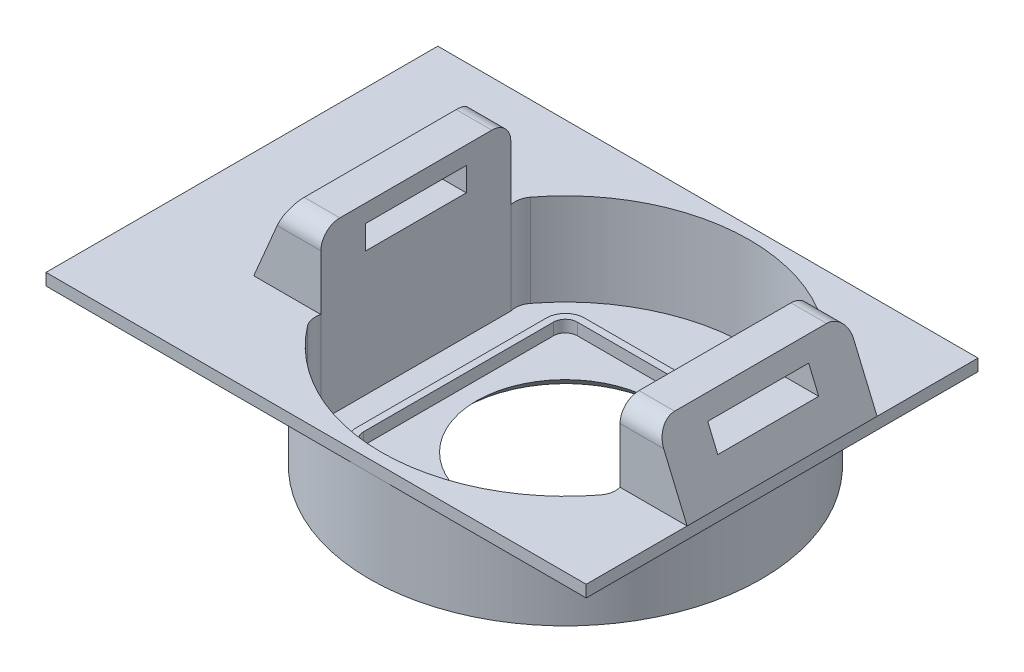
ISO-10303-21;
HEADER;
FILE_DESCRIPTION(('STEP AP214'),'2;1');
FILE_NAME('part.step','',(''),(''),'','','');
FILE_SCHEMA(('AUTOMOTIVE_DESIGN { 1 0 10303 214 1 1 1 1 }'));
ENDSEC;
DATA;
#1=APPLICATION_CONTEXT('core data for automotive mechanical design processes');
#2=APPLICATION_PROTOCOL_DEFINITION('international standard','automotive_design',2000,#1);
#3=PRODUCT_CONTEXT('',#1,'mechanical');
#4=PRODUCT('Part','Part','',(#3));
#5=PRODUCT_RELATED_PRODUCT_CATEGORY('part','',(#4));
#6=PRODUCT_DEFINITION_FORMATION('','',#4);
#7=PRODUCT_DEFINITION_CONTEXT('part definition',#1,'design');
#8=PRODUCT_DEFINITION('design','',#6,#7);
#9=PRODUCT_DEFINITION_SHAPE('','',#8);
#10=(LENGTH_UNIT() NAMED_UNIT(*) SI_UNIT(.MILLI.,.METRE.));
#11=(NAMED_UNIT(*) PLANE_ANGLE_UNIT() SI_UNIT($,.RADIAN.));
#12=(NAMED_UNIT(*) SI_UNIT($,.STERADIAN.) SOLID_ANGLE_UNIT());
#13=UNCERTAINTY_MEASURE_WITH_UNIT(LENGTH_MEASURE(1.E-05),#10,'distance_accuracy_value','');
#14=(GEOMETRIC_REPRESENTATION_CONTEXT(3) GLOBAL_UNCERTAINTY_ASSIGNED_CONTEXT((#13)) GLOBAL_UNIT_ASSIGNED_CONTEXT((#10,
#11,#12)) REPRESENTATION_CONTEXT('',''));
#15=CARTESIAN_POINT('',(0.,0.,0.));
#16=DIRECTION('',(0.,0.,1.));
#17=DIRECTION('',(1.,0.,0.));
#18=AXIS2_PLACEMENT_3D('',#15,#16,#17);
#19=CARTESIAN_POINT('',(0.,0.,0.));
#20=DIRECTION('',(0.,1.,0.));
#21=DIRECTION('',(-1.,0.,0.));
#22=AXIS2_PLACEMENT_3D('',#19,#20,#21);
#23=CYLINDRICAL_SURFACE('',#22,33.);
#24=CARTESIAN_POINT('',(0.,15.5,0.));
#25=DIRECTION('',(0.,-1.,0.));
#26=DIRECTION('',(-1.,0.,0.));
#27=AXIS2_PLACEMENT_3D('',#24,#25,#26);
#28=CIRCLE('',#27,33.);
#29=CARTESIAN_POINT('',(0.,15.5,-33.));
#30=VERTEX_POINT('',#29);
#31=CARTESIAN_POINT('',(33.,15.5,0.));
#32=VERTEX_POINT('',#31);
#33=EDGE_CURVE('E560',#30,#32,#28,.T.);
#34=ORIENTED_EDGE('',*,*,#33,.T.);
#35=DIRECTION('',(0.,-1.,0.));
#36=VECTOR('',#35,1.);
#37=CARTESIAN_POINT('',(33.,0.,0.));
#38=LINE('',#37,#36);
#39=CARTESIAN_POINT('',(33.,0.,0.));
#40=VERTEX_POINT('',#39);
#41=EDGE_CURVE('E11',#32,#40,#38,.T.);
#42=ORIENTED_EDGE('',*,*,#41,.T.);
#43=CARTESIAN_POINT('',(0.,0.,0.));
#44=DIRECTION('',(0.,1.,0.));
#45=DIRECTION('',(-1.,0.,0.));
#46=AXIS2_PLACEMENT_3D('',#43,#44,#45);
#47=CIRCLE('',#46,33.);
#48=CARTESIAN_POINT('',(-33.,0.,0.));
#49=VERTEX_POINT('',#48);
#50=EDGE_CURVE('E611',#40,#49,#47,.T.);
#51=ORIENTED_EDGE('',*,*,#50,.T.);
#52=CARTESIAN_POINT('',(0.,0.,0.));
#53=DIRECTION('',(0.,1.,0.));
#54=DIRECTION('',(-1.,0.,0.));
#55=AXIS2_PLACEMENT_3D('',#52,#53,#54);
#56=CIRCLE('',#55,33.);
#57=EDGE_CURVE('E616',#49,#40,#56,.T.);
#58=ORIENTED_EDGE('',*,*,#57,.T.);
#59=ORIENTED_EDGE('',*,*,#41,.F.);
#60=CARTESIAN_POINT('',(0.,15.5,0.));
#61=DIRECTION('',(0.,-1.,0.));
#62=DIRECTION('',(-1.,0.,0.));
#63=AXIS2_PLACEMENT_3D('',#60,#61,#62);
#64=CIRCLE('',#63,33.);
#65=CARTESIAN_POINT('',(0.,15.5,33.));
#66=VERTEX_POINT('',#65);
#67=EDGE_CURVE('E27',#32,#66,#64,.T.);
#68=ORIENTED_EDGE('',*,*,#67,.T.);
#69=CARTESIAN_POINT('',(0.,15.5,0.));
#70=DIRECTION('',(0.,-1.,0.));
#71=DIRECTION('',(-1.,0.,0.));
#72=AXIS2_PLACEMENT_3D('',#69,#70,#71);
#73=CIRCLE('',#72,33.);
#74=EDGE_CURVE('E787',#66,#30,#73,.T.);
#75=ORIENTED_EDGE('',*,*,#74,.T.);
#76=EDGE_LOOP('',(#34,#42,#51,#58,#59,#68,#75));
#77=FACE_BOUND('',#76,.T.);
#78=ADVANCED_FACE('F16',(#77),#23,.T.);
#79=CARTESIAN_POINT('',(18.25,15.5,0.));
#80=DIRECTION('',(0.,1.,0.));
#81=DIRECTION('',(1.,0.,0.));
#82=AXIS2_PLACEMENT_3D('',#79,#80,#81);
#83=PLANE('',#82);
#84=ORIENTED_EDGE('',*,*,#33,.F.);
#85=DIRECTION('',(1.,0.,0.));
#86=VECTOR('',#85,1.);
#87=CARTESIAN_POINT('',(36.5,15.5,-33.));
#88=LINE('',#87,#86);
#89=CARTESIAN_POINT('',(36.5,15.5,-33.));
#90=VERTEX_POINT('',#89);
#91=EDGE_CURVE('E450',#30,#90,#88,.T.);
#92=ORIENTED_EDGE('',*,*,#91,.T.);
#93=DIRECTION('',(0.,0.,1.));
#94=VECTOR('',#93,1.);
#95=CARTESIAN_POINT('',(36.5,15.5,33.));
#96=LINE('',#95,#94);
#97=CARTESIAN_POINT('',(36.5,15.5,33.));
#98=VERTEX_POINT('',#97);
#99=EDGE_CURVE('E557',#90,#98,#96,.T.);
#100=ORIENTED_EDGE('',*,*,#99,.T.);
#101=DIRECTION('',(-1.,0.,0.));
#102=VECTOR('',#101,1.);
#103=CARTESIAN_POINT('',(-54.5,15.5,33.));
#104=LINE('',#103,#102);
#105=EDGE_CURVE('E831',#98,#66,#104,.T.);
#106=ORIENTED_EDGE('',*,*,#105,.T.);
#107=ORIENTED_EDGE('',*,*,#67,.F.);
#108=EDGE_LOOP('',(#84,#92,#100,#106,#107));
#109=FACE_BOUND('',#108,.T.);
#110=ADVANCED_FACE('F1088',(#109),#83,.F.);
#111=CARTESIAN_POINT('',(36.5,17.5,-33.));
#112=DIRECTION('',(1.,0.,0.));
#113=DIRECTION('',(0.,0.,1.));
#114=AXIS2_PLACEMENT_3D('',#111,#112,#113);
#115=PLANE('',#114);
#116=DIRECTION('',(0.,0.,-1.));
#117=VECTOR('',#116,1.);
#118=CARTESIAN_POINT('',(36.5,17.5,33.));
#119=LINE('',#118,#117);
#120=CARTESIAN_POINT('',(36.5,17.5,33.));
#121=VERTEX_POINT('',#120);
#122=CARTESIAN_POINT('',(36.5,17.5,16.));
#123=VERTEX_POINT('',#122);
#124=EDGE_CURVE('E407',#121,#123,#119,.T.);
#125=ORIENTED_EDGE('',*,*,#124,.F.);
#126=DIRECTION('',(0.,-1.,0.));
#127=VECTOR('',#126,1.);
#128=CARTESIAN_POINT('',(36.5,17.5,33.));
#129=LINE('',#128,#127);
#130=EDGE_CURVE('E561',#121,#98,#129,.T.);
#131=ORIENTED_EDGE('',*,*,#130,.T.);
#132=ORIENTED_EDGE('',*,*,#99,.F.);
#133=DIRECTION('',(0.,-1.,0.));
#134=VECTOR('',#133,1.);
#135=CARTESIAN_POINT('',(36.5,17.5,-33.));
#136=LINE('',#135,#134);
#137=CARTESIAN_POINT('',(36.5,17.5,-33.));
#138=VERTEX_POINT('',#137);
#139=EDGE_CURVE('E393',#138,#90,#136,.T.);
#140=ORIENTED_EDGE('',*,*,#139,.F.);
#141=DIRECTION('',(0.,0.,-1.));
#142=VECTOR('',#141,1.);
#143=CARTESIAN_POINT('',(36.5,17.5,33.));
#144=LINE('',#143,#142);
#145=CARTESIAN_POINT('',(36.5,17.5,-16.));
#146=VERTEX_POINT('',#145);
#147=EDGE_CURVE('E695',#146,#138,#144,.T.);
#148=ORIENTED_EDGE('',*,*,#147,.F.);
#149=DIRECTION('',(0.,0.,-1.));
#150=VECTOR('',#149,1.);
#151=CARTESIAN_POINT('',(36.5,17.5,33.));
#152=LINE('',#151,#150);
#153=EDGE_CURVE('E430',#123,#146,#152,.T.);
#154=ORIENTED_EDGE('',*,*,#153,.F.);
#155=EDGE_LOOP('',(#125,#131,#132,#140,#148,#154));
#156=FACE_BOUND('',#155,.T.);
#157=ADVANCED_FACE('F1093',(#156),#115,.T.);
#158=CARTESIAN_POINT('',(36.5,17.5,33.));
#159=DIRECTION('',(0.,0.,1.));
#160=DIRECTION('',(1.,0.,0.));
#161=AXIS2_PLACEMENT_3D('',#158,#159,#160);
#162=PLANE('',#161);
#163=DIRECTION('',(1.,0.,0.));
#164=VECTOR('',#163,1.);
#165=CARTESIAN_POINT('',(-54.5,17.5,33.));
#166=LINE('',#165,#164);
#167=CARTESIAN_POINT('',(-54.5,17.5,33.));
#168=VERTEX_POINT('',#167);
#169=EDGE_CURVE('E522',#168,#121,#166,.T.);
#170=ORIENTED_EDGE('',*,*,#169,.F.);
#171=DIRECTION('',(0.,-1.,0.));
#172=VECTOR('',#171,1.);
#173=CARTESIAN_POINT('',(-54.5,17.5,33.));
#174=LINE('',#173,#172);
#175=CARTESIAN_POINT('',(-54.5,15.5,33.));
#176=VERTEX_POINT('',#175);
#177=EDGE_CURVE('E389',#168,#176,#174,.T.);
#178=ORIENTED_EDGE('',*,*,#177,.T.);
#179=DIRECTION('',(-1.,0.,0.));
#180=VECTOR('',#179,1.);
#181=CARTESIAN_POINT('',(-54.5,15.5,33.));
#182=LINE('',#181,#180);
#183=EDGE_CURVE('E791',#66,#176,#182,.T.);
#184=ORIENTED_EDGE('',*,*,#183,.F.);
#185=ORIENTED_EDGE('',*,*,#105,.F.);
#186=ORIENTED_EDGE('',*,*,#130,.F.);
#187=EDGE_LOOP('',(#170,#178,#184,#185,#186));
#188=FACE_BOUND('',#187,.T.);
#189=ADVANCED_FACE('F1144',(#188),#162,.T.);
#190=CARTESIAN_POINT('',(-27.25,15.5,0.));
#191=DIRECTION('',(0.,1.,0.));
#192=DIRECTION('',(1.,0.,0.));
#193=AXIS2_PLACEMENT_3D('',#190,#191,#192);
#194=PLANE('',#193);
#195=DIRECTION('',(1.,0.,0.));
#196=VECTOR('',#195,1.);
#197=CARTESIAN_POINT('',(36.5,15.5,-33.));
#198=LINE('',#197,#196);
#199=CARTESIAN_POINT('',(-54.5,15.5,-33.));
#200=VERTEX_POINT('',#199);
#201=EDGE_CURVE('E633',#200,#30,#198,.T.);
#202=ORIENTED_EDGE('',*,*,#201,.T.);
#203=ORIENTED_EDGE('',*,*,#74,.F.);
#204=ORIENTED_EDGE('',*,*,#183,.T.);
#205=DIRECTION('',(0.,0.,-1.));
#206=VECTOR('',#205,1.);
#207=CARTESIAN_POINT('',(-54.5,15.5,-33.));
#208=LINE('',#207,#206);
#209=EDGE_CURVE('E394',#176,#200,#208,.T.);
#210=ORIENTED_EDGE('',*,*,#209,.T.);
#211=EDGE_LOOP('',(#202,#203,#204,#210));
#212=FACE_BOUND('',#211,.T.);
#213=ADVANCED_FACE('F1140',(#212),#194,.F.);
#214=CARTESIAN_POINT('',(-54.5,17.5,-33.));
#215=DIRECTION('',(0.,0.,-1.));
#216=DIRECTION('',(0.,-1.,0.));
#217=AXIS2_PLACEMENT_3D('',#214,#215,#216);
#218=PLANE('',#217);
#219=DIRECTION('',(-1.,0.,0.));
#220=VECTOR('',#219,1.);
#221=CARTESIAN_POINT('',(36.5,17.5,-33.));
#222=LINE('',#221,#220);
#223=CARTESIAN_POINT('',(-54.5,17.5,-33.));
#224=VERTEX_POINT('',#223);
#225=EDGE_CURVE('E523',#138,#224,#222,.T.);
#226=ORIENTED_EDGE('',*,*,#225,.F.);
#227=ORIENTED_EDGE('',*,*,#139,.T.);
#228=ORIENTED_EDGE('',*,*,#91,.F.);
#229=ORIENTED_EDGE('',*,*,#201,.F.);
#230=DIRECTION('',(0.,-1.,0.));
#231=VECTOR('',#230,1.);
#232=CARTESIAN_POINT('',(-54.5,17.5,-33.));
#233=LINE('',#232,#231);
#234=EDGE_CURVE('E766',#224,#200,#233,.T.);
#235=ORIENTED_EDGE('',*,*,#234,.F.);
#236=EDGE_LOOP('',(#226,#227,#228,#229,#235));
#237=FACE_BOUND('',#236,.T.);
#238=ADVANCED_FACE('F1143',(#237),#218,.T.);
#239=CARTESIAN_POINT('',(-54.5,17.5,33.));
#240=DIRECTION('',(-1.,0.,0.));
#241=DIRECTION('',(0.,0.,1.));
#242=AXIS2_PLACEMENT_3D('',#239,#240,#241);
#243=PLANE('',#242);
#244=DIRECTION('',(0.,0.,1.));
#245=VECTOR('',#244,1.);
#246=CARTESIAN_POINT('',(-54.5,17.5,-33.));
#247=LINE('',#246,#245);
#248=EDGE_CURVE('E518',#224,#168,#247,.T.);
#249=ORIENTED_EDGE('',*,*,#248,.F.);
#250=ORIENTED_EDGE('',*,*,#234,.T.);
#251=ORIENTED_EDGE('',*,*,#209,.F.);
#252=ORIENTED_EDGE('',*,*,#177,.F.);
#253=EDGE_LOOP('',(#249,#250,#251,#252));
#254=FACE_BOUND('',#253,.T.);
#255=ADVANCED_FACE('F1173',(#254),#243,.T.);
#256=CARTESIAN_POINT('',(19.2,2.,-19.2));
#257=DIRECTION('',(0.,0.,-1.));
#258=DIRECTION('',(0.,-1.,0.));
#259=AXIS2_PLACEMENT_3D('',#256,#257,#258);
#260=PLANE('',#259);
#261=DIRECTION('',(0.,1.,0.));
#262=VECTOR('',#261,1.);
#263=CARTESIAN_POINT('',(16.,2.,-19.2));
#264=LINE('',#263,#262);
#265=CARTESIAN_POINT('',(16.,2.,-19.2));
#266=VERTEX_POINT('',#265);
#267=CARTESIAN_POINT('',(16.,4.,-19.2));
#268=VERTEX_POINT('',#267);
#269=EDGE_CURVE('E478',#266,#268,#264,.T.);
#270=ORIENTED_EDGE('',*,*,#269,.F.);
#271=DIRECTION('',(1.,0.,0.));
#272=VECTOR('',#271,1.);
#273=CARTESIAN_POINT('',(9.6,2.,-19.2));
#274=LINE('',#273,#272);
#275=CARTESIAN_POINT('',(-16.,2.,-19.2));
#276=VERTEX_POINT('',#275);
#277=EDGE_CURVE('E681',#276,#266,#274,.T.);
#278=ORIENTED_EDGE('',*,*,#277,.F.);
#279=DIRECTION('',(0.,-1.,0.));
#280=VECTOR('',#279,1.);
#281=CARTESIAN_POINT('',(-16.,2.,-19.2));
#282=LINE('',#281,#280);
#283=CARTESIAN_POINT('',(-16.,4.,-19.2));
#284=VERTEX_POINT('',#283);
#285=EDGE_CURVE('E474',#284,#276,#282,.T.);
#286=ORIENTED_EDGE('',*,*,#285,.F.);
#287=DIRECTION('',(-1.,0.,0.));
#288=VECTOR('',#287,1.);
#289=CARTESIAN_POINT('',(19.2,4.,-19.2));
#290=LINE('',#289,#288);
#291=EDGE_CURVE('E500',#268,#284,#290,.T.);
#292=ORIENTED_EDGE('',*,*,#291,.F.);
#293=EDGE_LOOP('',(#270,#278,#286,#292));
#294=FACE_BOUND('',#293,.T.);
#295=ADVANCED_FACE('F1149',(#294),#260,.T.);
#296=CARTESIAN_POINT('',(-19.2,2.,19.2));
#297=DIRECTION('',(0.,0.,1.));
#298=DIRECTION('',(1.,0.,0.));
#299=AXIS2_PLACEMENT_3D('',#296,#297,#298);
#300=PLANE('',#299);
#301=DIRECTION('',(0.,1.,0.));
#302=VECTOR('',#301,1.);
#303=CARTESIAN_POINT('',(-16.,2.,19.2));
#304=LINE('',#303,#302);
#305=CARTESIAN_POINT('',(-16.,2.,19.2));
#306=VERTEX_POINT('',#305);
#307=CARTESIAN_POINT('',(-16.,4.,19.2));
#308=VERTEX_POINT('',#307);
#309=EDGE_CURVE('E634',#306,#308,#304,.T.);
#310=ORIENTED_EDGE('',*,*,#309,.F.);
#311=DIRECTION('',(-1.,0.,0.));
#312=VECTOR('',#311,1.);
#313=CARTESIAN_POINT('',(-9.6,2.,19.2));
#314=LINE('',#313,#312);
#315=CARTESIAN_POINT('',(16.,2.,19.2));
#316=VERTEX_POINT('',#315);
#317=EDGE_CURVE('E547',#316,#306,#314,.T.);
#318=ORIENTED_EDGE('',*,*,#317,.F.);
#319=DIRECTION('',(0.,-1.,0.));
#320=VECTOR('',#319,1.);
#321=CARTESIAN_POINT('',(16.,2.,19.2));
#322=LINE('',#321,#320);
#323=CARTESIAN_POINT('',(16.,4.,19.2));
#324=VERTEX_POINT('',#323);
#325=EDGE_CURVE('E864',#324,#316,#322,.T.);
#326=ORIENTED_EDGE('',*,*,#325,.F.);
#327=DIRECTION('',(1.,0.,0.));
#328=VECTOR('',#327,1.);
#329=CARTESIAN_POINT('',(-19.2,4.,19.2));
#330=LINE('',#329,#328);
#331=EDGE_CURVE('E736',#308,#324,#330,.T.);
#332=ORIENTED_EDGE('',*,*,#331,.F.);
#333=EDGE_LOOP('',(#310,#318,#326,#332));
#334=FACE_BOUND('',#333,.T.);
#335=ADVANCED_FACE('F1146',(#334),#300,.T.);
#336=CARTESIAN_POINT('',(18.,2.,-18.));
#337=DIRECTION('',(-1.,0.,0.));
#338=DIRECTION('',(0.,1.,0.));
#339=AXIS2_PLACEMENT_3D('',#336,#337,#338);
#340=PLANE('',#339);
#341=DIRECTION('',(0.,-1.,0.));
#342=VECTOR('',#341,1.);
#343=CARTESIAN_POINT('',(18.,2.,16.));
#344=LINE('',#343,#342);
#345=CARTESIAN_POINT('',(18.,4.,16.));
#346=VERTEX_POINT('',#345);
#347=CARTESIAN_POINT('',(18.,2.,16.));
#348=VERTEX_POINT('',#347);
#349=EDGE_CURVE('E451',#346,#348,#344,.T.);
#350=ORIENTED_EDGE('',*,*,#349,.F.);
#351=DIRECTION('',(0.,0.,1.));
#352=VECTOR('',#351,1.);
#353=CARTESIAN_POINT('',(18.,4.,-18.));
#354=LINE('',#353,#352);
#355=CARTESIAN_POINT('',(18.,4.,-16.));
#356=VERTEX_POINT('',#355);
#357=EDGE_CURVE('E758',#356,#346,#354,.T.);
#358=ORIENTED_EDGE('',*,*,#357,.F.);
#359=DIRECTION('',(0.,1.,0.));
#360=VECTOR('',#359,1.);
#361=CARTESIAN_POINT('',(18.,2.,-16.));
#362=LINE('',#361,#360);
#363=CARTESIAN_POINT('',(18.,2.,-16.));
#364=VERTEX_POINT('',#363);
#365=EDGE_CURVE('E455',#364,#356,#362,.T.);
#366=ORIENTED_EDGE('',*,*,#365,.F.);
#367=DIRECTION('',(0.,0.,-1.));
#368=VECTOR('',#367,1.);
#369=CARTESIAN_POINT('',(18.,2.,-9.));
#370=LINE('',#369,#368);
#371=EDGE_CURVE('E565',#348,#364,#370,.T.);
#372=ORIENTED_EDGE('',*,*,#371,.F.);
#373=EDGE_LOOP('',(#350,#358,#366,#372));
#374=FACE_BOUND('',#373,.T.);
#375=ADVANCED_FACE('F1028',(#374),#340,.T.);
#376=CARTESIAN_POINT('',(-18.,2.,18.));
#377=DIRECTION('',(1.,0.,0.));
#378=DIRECTION('',(0.,0.,-1.));
#379=AXIS2_PLACEMENT_3D('',#376,#377,#378);
#380=PLANE('',#379);
#381=DIRECTION('',(0.,1.,0.));
#382=VECTOR('',#381,1.);
#383=CARTESIAN_POINT('',(-18.,2.,16.));
#384=LINE('',#383,#382);
#385=CARTESIAN_POINT('',(-18.,2.,16.));
#386=VERTEX_POINT('',#385);
#387=CARTESIAN_POINT('',(-18.,4.,16.));
#388=VERTEX_POINT('',#387);
#389=EDGE_CURVE('E507',#386,#388,#384,.T.);
#390=ORIENTED_EDGE('',*,*,#389,.F.);
#391=DIRECTION('',(0.,0.,1.));
#392=VECTOR('',#391,1.);
#393=CARTESIAN_POINT('',(-18.,2.,9.));
#394=LINE('',#393,#392);
#395=CARTESIAN_POINT('',(-18.,2.,-16.));
#396=VERTEX_POINT('',#395);
#397=EDGE_CURVE('E701',#396,#386,#394,.T.);
#398=ORIENTED_EDGE('',*,*,#397,.F.);
#399=DIRECTION('',(0.,-1.,0.));
#400=VECTOR('',#399,1.);
#401=CARTESIAN_POINT('',(-18.,2.,-16.));
#402=LINE('',#401,#400);
#403=CARTESIAN_POINT('',(-18.,4.,-16.));
#404=VERTEX_POINT('',#403);
#405=EDGE_CURVE('E434',#404,#396,#402,.T.);
#406=ORIENTED_EDGE('',*,*,#405,.F.);
#407=DIRECTION('',(0.,0.,-1.));
#408=VECTOR('',#407,1.);
#409=CARTESIAN_POINT('',(-18.,4.,18.));
#410=LINE('',#409,#408);
#411=EDGE_CURVE('E628',#388,#404,#410,.T.);
#412=ORIENTED_EDGE('',*,*,#411,.F.);
#413=EDGE_LOOP('',(#390,#398,#406,#412));
#414=FACE_BOUND('',#413,.T.);
#415=ADVANCED_FACE('F1047',(#414),#380,.T.);
#416=CARTESIAN_POINT('',(-16.,2.,-16.));
#417=DIRECTION('',(0.,1.,0.));
#418=DIRECTION('',(-0.707106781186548,0.,-0.707106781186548));
#419=AXIS2_PLACEMENT_3D('',#416,#417,#418);
#420=CYLINDRICAL_SURFACE('',#419,2.);
#421=CARTESIAN_POINT('',(-16.,2.,-16.));
#422=DIRECTION('',(0.,1.,0.));
#423=DIRECTION('',(-0.707106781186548,0.,-0.707106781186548));
#424=AXIS2_PLACEMENT_3D('',#421,#422,#423);
#425=CIRCLE('',#424,2.);
#426=CARTESIAN_POINT('',(-16.,2.,-18.));
#427=VERTEX_POINT('',#426);
#428=EDGE_CURVE('E697',#427,#396,#425,.T.);
#429=ORIENTED_EDGE('',*,*,#428,.F.);
#430=DIRECTION('',(0.,1.,0.));
#431=VECTOR('',#430,1.);
#432=CARTESIAN_POINT('',(-16.,2.,-18.));
#433=LINE('',#432,#431);
#434=CARTESIAN_POINT('',(-16.,4.,-18.));
#435=VERTEX_POINT('',#434);
#436=EDGE_CURVE('E516',#427,#435,#433,.T.);
#437=ORIENTED_EDGE('',*,*,#436,.T.);
#438=CARTESIAN_POINT('',(-16.,4.,-16.));
#439=DIRECTION('',(0.,1.,0.));
#440=DIRECTION('',(-0.707106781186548,0.,-0.707106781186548));
#441=AXIS2_PLACEMENT_3D('',#438,#439,#440);
#442=CIRCLE('',#441,2.);
#443=EDGE_CURVE('E649',#435,#404,#442,.T.);
#444=ORIENTED_EDGE('',*,*,#443,.T.);
#445=ORIENTED_EDGE('',*,*,#405,.T.);
#446=EDGE_LOOP('',(#429,#437,#444,#445));
#447=FACE_BOUND('',#446,.T.);
#448=ADVANCED_FACE('F1041',(#447),#420,.F.);
#449=CARTESIAN_POINT('',(-18.,2.,-18.));
#450=DIRECTION('',(0.,0.,1.));
#451=DIRECTION('',(1.,0.,0.));
#452=AXIS2_PLACEMENT_3D('',#449,#450,#451);
#453=PLANE('',#452);
#454=DIRECTION('',(0.,-1.,0.));
#455=VECTOR('',#454,1.);
#456=CARTESIAN_POINT('',(16.,2.,-18.));
#457=LINE('',#456,#455);
#458=CARTESIAN_POINT('',(16.,4.,-18.));
#459=VERTEX_POINT('',#458);
#460=CARTESIAN_POINT('',(16.,2.,-18.));
#461=VERTEX_POINT('',#460);
#462=EDGE_CURVE('E514',#459,#461,#457,.T.);
#463=ORIENTED_EDGE('',*,*,#462,.F.);
#464=DIRECTION('',(1.,0.,0.));
#465=VECTOR('',#464,1.);
#466=CARTESIAN_POINT('',(-18.,4.,-18.));
#467=LINE('',#466,#465);
#468=EDGE_CURVE('E653',#435,#459,#467,.T.);
#469=ORIENTED_EDGE('',*,*,#468,.F.);
#470=ORIENTED_EDGE('',*,*,#436,.F.);
#471=DIRECTION('',(-1.,0.,0.));
#472=VECTOR('',#471,1.);
#473=CARTESIAN_POINT('',(-9.,2.,-18.));
#474=LINE('',#473,#472);
#475=EDGE_CURVE('E578',#461,#427,#474,.T.);
#476=ORIENTED_EDGE('',*,*,#475,.F.);
#477=EDGE_LOOP('',(#463,#469,#470,#476));
#478=FACE_BOUND('',#477,.T.);
#479=ADVANCED_FACE('F1037',(#478),#453,.T.);
#480=CARTESIAN_POINT('',(16.,2.,-16.));
#481=DIRECTION('',(0.,1.,0.));
#482=DIRECTION('',(0.707106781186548,0.,-0.707106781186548));
#483=AXIS2_PLACEMENT_3D('',#480,#481,#482);
#484=CYLINDRICAL_SURFACE('',#483,2.);
#485=CARTESIAN_POINT('',(16.,2.,-16.));
#486=DIRECTION('',(0.,1.,0.));
#487=DIRECTION('',(0.707106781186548,0.,-0.707106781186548));
#488=AXIS2_PLACEMENT_3D('',#485,#486,#487);
#489=CIRCLE('',#488,2.);
#490=EDGE_CURVE('E568',#364,#461,#489,.T.);
#491=ORIENTED_EDGE('',*,*,#490,.F.);
#492=ORIENTED_EDGE('',*,*,#365,.T.);
#493=CARTESIAN_POINT('',(16.,4.,-16.));
#494=DIRECTION('',(0.,1.,0.));
#495=DIRECTION('',(0.707106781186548,0.,-0.707106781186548));
#496=AXIS2_PLACEMENT_3D('',#493,#494,#495);
#497=CIRCLE('',#496,2.);
#498=EDGE_CURVE('E743',#356,#459,#497,.T.);
#499=ORIENTED_EDGE('',*,*,#498,.T.);
#500=ORIENTED_EDGE('',*,*,#462,.T.);
#501=EDGE_LOOP('',(#491,#492,#499,#500));
#502=FACE_BOUND('',#501,.T.);
#503=ADVANCED_FACE('F1031',(#502),#484,.F.);
#504=CARTESIAN_POINT('',(16.,2.,16.));
#505=DIRECTION('',(0.,1.,0.));
#506=DIRECTION('',(0.707106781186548,0.,0.707106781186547));
#507=AXIS2_PLACEMENT_3D('',#504,#505,#506);
#508=CYLINDRICAL_SURFACE('',#507,2.);
#509=CARTESIAN_POINT('',(16.,2.,16.));
#510=DIRECTION('',(0.,1.,0.));
#511=DIRECTION('',(0.707106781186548,0.,0.707106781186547));
#512=AXIS2_PLACEMENT_3D('',#509,#510,#511);
#513=CIRCLE('',#512,2.);
#514=CARTESIAN_POINT('',(16.,2.,18.));
#515=VERTEX_POINT('',#514);
#516=EDGE_CURVE('E569',#515,#348,#513,.T.);
#517=ORIENTED_EDGE('',*,*,#516,.F.);
#518=DIRECTION('',(0.,1.,0.));
#519=VECTOR('',#518,1.);
#520=CARTESIAN_POINT('',(16.,2.,18.));
#521=LINE('',#520,#519);
#522=CARTESIAN_POINT('',(16.,4.,18.));
#523=VERTEX_POINT('',#522);
#524=EDGE_CURVE('E456',#515,#523,#521,.T.);
#525=ORIENTED_EDGE('',*,*,#524,.T.);
#526=CARTESIAN_POINT('',(16.,4.,16.));
#527=DIRECTION('',(0.,1.,0.));
#528=DIRECTION('',(0.707106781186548,0.,0.707106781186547));
#529=AXIS2_PLACEMENT_3D('',#526,#527,#528);
#530=CIRCLE('',#529,2.);
#531=EDGE_CURVE('E815',#523,#346,#530,.T.);
#532=ORIENTED_EDGE('',*,*,#531,.T.);
#533=ORIENTED_EDGE('',*,*,#349,.T.);
#534=EDGE_LOOP('',(#517,#525,#532,#533));
#535=FACE_BOUND('',#534,.T.);
#536=ADVANCED_FACE('F1125',(#535),#508,.F.);
#537=CARTESIAN_POINT('',(18.,2.,18.));
#538=DIRECTION('',(0.,0.,-1.));
#539=DIRECTION('',(0.,-1.,0.));
#540=AXIS2_PLACEMENT_3D('',#537,#538,#539);
#541=PLANE('',#540);
#542=DIRECTION('',(0.,-1.,0.));
#543=VECTOR('',#542,1.);
#544=CARTESIAN_POINT('',(-16.,2.,18.));
#545=LINE('',#544,#543);
#546=CARTESIAN_POINT('',(-16.,4.,18.));
#547=VERTEX_POINT('',#546);
#548=CARTESIAN_POINT('',(-16.,2.,18.));
#549=VERTEX_POINT('',#548);
#550=EDGE_CURVE('E510',#547,#549,#545,.T.);
#551=ORIENTED_EDGE('',*,*,#550,.F.);
#552=DIRECTION('',(-1.,0.,0.));
#553=VECTOR('',#552,1.);
#554=CARTESIAN_POINT('',(18.,4.,18.));
#555=LINE('',#554,#553);
#556=EDGE_CURVE('E629',#523,#547,#555,.T.);
#557=ORIENTED_EDGE('',*,*,#556,.F.);
#558=ORIENTED_EDGE('',*,*,#524,.F.);
#559=DIRECTION('',(1.,0.,0.));
#560=VECTOR('',#559,1.);
#561=CARTESIAN_POINT('',(9.,2.,18.));
#562=LINE('',#561,#560);
#563=EDGE_CURVE('E580',#549,#515,#562,.T.);
#564=ORIENTED_EDGE('',*,*,#563,.F.);
#565=EDGE_LOOP('',(#551,#557,#558,#564));
#566=FACE_BOUND('',#565,.T.);
#567=ADVANCED_FACE('F1227',(#566),#541,.T.);
#568=CARTESIAN_POINT('',(0.,2.,0.));
#569=DIRECTION('',(0.,1.,0.));
#570=DIRECTION('',(1.,0.,0.));
#571=AXIS2_PLACEMENT_3D('',#568,#569,#570);
#572=PLANE('',#571);
#573=CARTESIAN_POINT('',(0.,2.,0.));
#574=DIRECTION('',(0.,-1.,0.));
#575=DIRECTION('',(1.,0.,0.));
#576=AXIS2_PLACEMENT_3D('',#573,#574,#575);
#577=CIRCLE('',#576,15.);
#578=CARTESIAN_POINT('',(-15.,2.,0.));
#579=VERTEX_POINT('',#578);
#580=EDGE_CURVE('E488',#579,#579,#577,.T.);
#581=ORIENTED_EDGE('',*,*,#580,.T.);
#582=EDGE_LOOP('',(#581));
#583=FACE_BOUND('',#582,.T.);
#584=CARTESIAN_POINT('',(-16.,2.,16.));
#585=DIRECTION('',(0.,1.,0.));
#586=DIRECTION('',(-0.707106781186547,0.,0.707106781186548));
#587=AXIS2_PLACEMENT_3D('',#584,#585,#586);
#588=CIRCLE('',#587,2.);
#589=EDGE_CURVE('E477',#386,#549,#588,.T.);
#590=ORIENTED_EDGE('',*,*,#589,.T.);
#591=ORIENTED_EDGE('',*,*,#563,.T.);
#592=ORIENTED_EDGE('',*,*,#516,.T.);
#593=ORIENTED_EDGE('',*,*,#371,.T.);
#594=ORIENTED_EDGE('',*,*,#490,.T.);
#595=ORIENTED_EDGE('',*,*,#475,.T.);
#596=ORIENTED_EDGE('',*,*,#428,.T.);
#597=ORIENTED_EDGE('',*,*,#397,.T.);
#598=EDGE_LOOP('',(#590,#591,#592,#593,#594,#595,#596,#597));
#599=FACE_BOUND('',#598,.T.);
#600=ADVANCED_FACE('F1034',(#583,#599),#572,.T.);
#601=CARTESIAN_POINT('',(-16.,2.,16.));
#602=DIRECTION('',(0.,1.,0.));
#603=DIRECTION('',(-0.707106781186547,0.,0.707106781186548));
#604=AXIS2_PLACEMENT_3D('',#601,#602,#603);
#605=CYLINDRICAL_SURFACE('',#604,2.);
#606=ORIENTED_EDGE('',*,*,#589,.F.);
#607=ORIENTED_EDGE('',*,*,#389,.T.);
#608=CARTESIAN_POINT('',(-16.,4.,16.));
#609=DIRECTION('',(0.,1.,0.));
#610=DIRECTION('',(-0.707106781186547,0.,0.707106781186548));
#611=AXIS2_PLACEMENT_3D('',#608,#609,#610);
#612=CIRCLE('',#611,2.);
#613=EDGE_CURVE('E624',#388,#547,#612,.T.);
#614=ORIENTED_EDGE('',*,*,#613,.T.);
#615=ORIENTED_EDGE('',*,*,#550,.T.);
#616=EDGE_LOOP('',(#606,#607,#614,#615));
#617=FACE_BOUND('',#616,.T.);
#618=ADVANCED_FACE('F1238',(#617),#605,.F.);
#619=CARTESIAN_POINT('',(-16.,2.,-16.));
#620=DIRECTION('',(0.,1.,0.));
#621=DIRECTION('',(-0.707106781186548,0.,-0.707106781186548));
#622=AXIS2_PLACEMENT_3D('',#619,#620,#621);
#623=CYLINDRICAL_SURFACE('',#622,3.2);
#624=CARTESIAN_POINT('',(-16.,4.,-16.));
#625=DIRECTION('',(0.,-1.,0.));
#626=DIRECTION('',(-0.707106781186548,0.,-0.707106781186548));
#627=AXIS2_PLACEMENT_3D('',#624,#625,#626);
#628=CIRCLE('',#627,3.2);
#629=CARTESIAN_POINT('',(-19.2,4.,-16.));
#630=VERTEX_POINT('',#629);
#631=EDGE_CURVE('E754',#630,#284,#628,.T.);
#632=ORIENTED_EDGE('',*,*,#631,.T.);
#633=ORIENTED_EDGE('',*,*,#285,.T.);
#634=CARTESIAN_POINT('',(-16.,2.,-16.));
#635=DIRECTION('',(0.,1.,0.));
#636=DIRECTION('',(-0.707106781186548,0.,-0.707106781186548));
#637=AXIS2_PLACEMENT_3D('',#634,#635,#636);
#638=CIRCLE('',#637,3.2);
#639=CARTESIAN_POINT('',(-19.2,2.,-16.));
#640=VERTEX_POINT('',#639);
#641=EDGE_CURVE('E682',#276,#640,#638,.T.);
#642=ORIENTED_EDGE('',*,*,#641,.T.);
#643=DIRECTION('',(0.,1.,0.));
#644=VECTOR('',#643,1.);
#645=CARTESIAN_POINT('',(-19.2,2.,-16.));
#646=LINE('',#645,#644);
#647=EDGE_CURVE('E387',#640,#630,#646,.T.);
#648=ORIENTED_EDGE('',*,*,#647,.T.);
#649=EDGE_LOOP('',(#632,#633,#642,#648));
#650=FACE_BOUND('',#649,.T.);
#651=ADVANCED_FACE('F1121',(#650),#623,.T.);
#652=CARTESIAN_POINT('',(16.,2.,-16.));
#653=DIRECTION('',(0.,1.,0.));
#654=DIRECTION('',(0.707106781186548,0.,-0.707106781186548));
#655=AXIS2_PLACEMENT_3D('',#652,#653,#654);
#656=CYLINDRICAL_SURFACE('',#655,3.2);
#657=CARTESIAN_POINT('',(16.,4.,-16.));
#658=DIRECTION('',(0.,-1.,0.));
#659=DIRECTION('',(0.707106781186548,0.,-0.707106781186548));
#660=AXIS2_PLACEMENT_3D('',#657,#658,#659);
#661=CIRCLE('',#660,3.2);
#662=CARTESIAN_POINT('',(19.2,4.,-16.));
#663=VERTEX_POINT('',#662);
#664=EDGE_CURVE('E496',#268,#663,#661,.T.);
#665=ORIENTED_EDGE('',*,*,#664,.T.);
#666=DIRECTION('',(0.,-1.,0.));
#667=VECTOR('',#666,1.);
#668=CARTESIAN_POINT('',(19.2,2.,-16.));
#669=LINE('',#668,#667);
#670=CARTESIAN_POINT('',(19.2,2.,-16.));
#671=VERTEX_POINT('',#670);
#672=EDGE_CURVE('E759',#663,#671,#669,.T.);
#673=ORIENTED_EDGE('',*,*,#672,.T.);
#674=CARTESIAN_POINT('',(16.,2.,-16.));
#675=DIRECTION('',(0.,1.,0.));
#676=DIRECTION('',(0.707106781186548,0.,-0.707106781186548));
#677=AXIS2_PLACEMENT_3D('',#674,#675,#676);
#678=CIRCLE('',#677,3.2);
#679=EDGE_CURVE('E677',#671,#266,#678,.T.);
#680=ORIENTED_EDGE('',*,*,#679,.T.);
#681=ORIENTED_EDGE('',*,*,#269,.T.);
#682=EDGE_LOOP('',(#665,#673,#680,#681));
#683=FACE_BOUND('',#682,.T.);
#684=ADVANCED_FACE('F1117',(#683),#656,.T.);
#685=CARTESIAN_POINT('',(19.2,2.,19.2));
#686=DIRECTION('',(1.,0.,0.));
#687=DIRECTION('',(0.,1.,0.));
#688=AXIS2_PLACEMENT_3D('',#685,#686,#687);
#689=PLANE('',#688);
#690=DIRECTION('',(0.,1.,0.));
#691=VECTOR('',#690,1.);
#692=CARTESIAN_POINT('',(19.2,2.,16.));
#693=LINE('',#692,#691);
#694=CARTESIAN_POINT('',(19.2,2.,16.));
#695=VERTEX_POINT('',#694);
#696=CARTESIAN_POINT('',(19.2,4.,16.));
#697=VERTEX_POINT('',#696);
#698=EDGE_CURVE('E762',#695,#697,#693,.T.);
#699=ORIENTED_EDGE('',*,*,#698,.F.);
#700=DIRECTION('',(0.,0.,1.));
#701=VECTOR('',#700,1.);
#702=CARTESIAN_POINT('',(19.2,2.,9.6));
#703=LINE('',#702,#701);
#704=EDGE_CURVE('E548',#671,#695,#703,.T.);
#705=ORIENTED_EDGE('',*,*,#704,.F.);
#706=ORIENTED_EDGE('',*,*,#672,.F.);
#707=DIRECTION('',(0.,0.,-1.));
#708=VECTOR('',#707,1.);
#709=CARTESIAN_POINT('',(19.2,4.,19.2));
#710=LINE('',#709,#708);
#711=EDGE_CURVE('E501',#697,#663,#710,.T.);
#712=ORIENTED_EDGE('',*,*,#711,.F.);
#713=EDGE_LOOP('',(#699,#705,#706,#712));
#714=FACE_BOUND('',#713,.T.);
#715=ADVANCED_FACE('F1120',(#714),#689,.T.);
#716=CARTESIAN_POINT('',(16.,2.,16.));
#717=DIRECTION('',(0.,1.,0.));
#718=DIRECTION('',(0.707106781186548,0.,0.707106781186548));
#719=AXIS2_PLACEMENT_3D('',#716,#717,#718);
#720=CYLINDRICAL_SURFACE('',#719,3.2);
#721=CARTESIAN_POINT('',(16.,4.,16.));
#722=DIRECTION('',(0.,-1.,0.));
#723=DIRECTION('',(0.707106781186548,0.,0.707106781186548));
#724=AXIS2_PLACEMENT_3D('',#721,#722,#723);
#725=CIRCLE('',#724,3.2);
#726=EDGE_CURVE('E732',#697,#324,#725,.T.);
#727=ORIENTED_EDGE('',*,*,#726,.T.);
#728=ORIENTED_EDGE('',*,*,#325,.T.);
#729=CARTESIAN_POINT('',(16.,2.,16.));
#730=DIRECTION('',(0.,1.,0.));
#731=DIRECTION('',(0.707106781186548,0.,0.707106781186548));
#732=AXIS2_PLACEMENT_3D('',#729,#730,#731);
#733=CIRCLE('',#732,3.2);
#734=EDGE_CURVE('E543',#316,#695,#733,.T.);
#735=ORIENTED_EDGE('',*,*,#734,.T.);
#736=ORIENTED_EDGE('',*,*,#698,.T.);
#737=EDGE_LOOP('',(#727,#728,#735,#736));
#738=FACE_BOUND('',#737,.T.);
#739=ADVANCED_FACE('F1115',(#738),#720,.T.);
#740=CARTESIAN_POINT('',(0.,4.,0.));
#741=DIRECTION('',(0.,1.,0.));
#742=DIRECTION('',(1.,0.,0.));
#743=AXIS2_PLACEMENT_3D('',#740,#741,#742);
#744=PLANE('',#743);
#745=ORIENTED_EDGE('',*,*,#357,.T.);
#746=ORIENTED_EDGE('',*,*,#531,.F.);
#747=ORIENTED_EDGE('',*,*,#556,.T.);
#748=ORIENTED_EDGE('',*,*,#613,.F.);
#749=ORIENTED_EDGE('',*,*,#411,.T.);
#750=ORIENTED_EDGE('',*,*,#443,.F.);
#751=ORIENTED_EDGE('',*,*,#468,.T.);
#752=ORIENTED_EDGE('',*,*,#498,.F.);
#753=EDGE_LOOP('',(#745,#746,#747,#748,#749,#750,#751,#752));
#754=FACE_BOUND('',#753,.T.);
#755=CARTESIAN_POINT('',(-16.,4.,16.));
#756=DIRECTION('',(0.,-1.,0.));
#757=DIRECTION('',(-0.707106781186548,0.,0.707106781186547));
#758=AXIS2_PLACEMENT_3D('',#755,#756,#757);
#759=CIRCLE('',#758,3.2);
#760=CARTESIAN_POINT('',(-19.2,4.,16.));
#761=VERTEX_POINT('',#760);
#762=EDGE_CURVE('E399',#308,#761,#759,.T.);
#763=ORIENTED_EDGE('',*,*,#762,.F.);
#764=ORIENTED_EDGE('',*,*,#331,.T.);
#765=ORIENTED_EDGE('',*,*,#726,.F.);
#766=ORIENTED_EDGE('',*,*,#711,.T.);
#767=ORIENTED_EDGE('',*,*,#664,.F.);
#768=ORIENTED_EDGE('',*,*,#291,.T.);
#769=ORIENTED_EDGE('',*,*,#631,.F.);
#770=DIRECTION('',(0.,0.,1.));
#771=VECTOR('',#770,1.);
#772=CARTESIAN_POINT('',(-19.2,4.,-19.2));
#773=LINE('',#772,#771);
#774=EDGE_CURVE('E638',#630,#761,#773,.T.);
#775=ORIENTED_EDGE('',*,*,#774,.T.);
#776=EDGE_LOOP('',(#763,#764,#765,#766,#767,#768,#769,#775));
#777=FACE_BOUND('',#776,.T.);
#778=ADVANCED_FACE('F1112',(#754,#777),#744,.T.);
#779=CARTESIAN_POINT('',(-19.2,2.,-19.2));
#780=DIRECTION('',(-1.,0.,0.));
#781=DIRECTION('',(0.,0.,1.));
#782=AXIS2_PLACEMENT_3D('',#779,#780,#781);
#783=PLANE('',#782);
#784=DIRECTION('',(0.,-1.,0.));
#785=VECTOR('',#784,1.);
#786=CARTESIAN_POINT('',(-19.2,2.,16.));
#787=LINE('',#786,#785);
#788=CARTESIAN_POINT('',(-19.2,2.,16.));
#789=VERTEX_POINT('',#788);
#790=EDGE_CURVE('E639',#761,#789,#787,.T.);
#791=ORIENTED_EDGE('',*,*,#790,.F.);
#792=ORIENTED_EDGE('',*,*,#774,.F.);
#793=ORIENTED_EDGE('',*,*,#647,.F.);
#794=DIRECTION('',(0.,0.,-1.));
#795=VECTOR('',#794,1.);
#796=CARTESIAN_POINT('',(-19.2,2.,-9.6));
#797=LINE('',#796,#795);
#798=EDGE_CURVE('E686',#789,#640,#797,.T.);
#799=ORIENTED_EDGE('',*,*,#798,.F.);
#800=EDGE_LOOP('',(#791,#792,#793,#799));
#801=FACE_BOUND('',#800,.T.);
#802=ADVANCED_FACE('F1082',(#801),#783,.T.);
#803=CARTESIAN_POINT('',(-16.,2.,16.));
#804=DIRECTION('',(0.,1.,0.));
#805=DIRECTION('',(-0.707106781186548,0.,0.707106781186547));
#806=AXIS2_PLACEMENT_3D('',#803,#804,#805);
#807=CYLINDRICAL_SURFACE('',#806,3.2);
#808=ORIENTED_EDGE('',*,*,#762,.T.);
#809=ORIENTED_EDGE('',*,*,#790,.T.);
#810=CARTESIAN_POINT('',(-16.,2.,16.));
#811=DIRECTION('',(0.,1.,0.));
#812=DIRECTION('',(-0.707106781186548,0.,0.707106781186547));
#813=AXIS2_PLACEMENT_3D('',#810,#811,#812);
#814=CIRCLE('',#813,3.2);
#815=EDGE_CURVE('E709',#789,#306,#814,.T.);
#816=ORIENTED_EDGE('',*,*,#815,.T.);
#817=ORIENTED_EDGE('',*,*,#309,.T.);
#818=EDGE_LOOP('',(#808,#809,#816,#817));
#819=FACE_BOUND('',#818,.T.);
#820=ADVANCED_FACE('F1072',(#819),#807,.T.);
#821=CARTESIAN_POINT('',(25.2,17.5,16.));
#822=DIRECTION('',(-1.,0.,0.));
#823=DIRECTION('',(0.,1.,0.));
#824=AXIS2_PLACEMENT_3D('',#821,#822,#823);
#825=PLANE('',#824);
#826=DIRECTION('',(0.,1.,0.));
#827=VECTOR('',#826,1.);
#828=CARTESIAN_POINT('',(25.2,20.25,-8.5));
#829=LINE('',#828,#827);
#830=CARTESIAN_POINT('',(25.2,23.,-8.5));
#831=VERTEX_POINT('',#830);
#832=CARTESIAN_POINT('',(25.2,27.,-8.5));
#833=VERTEX_POINT('',#832);
#834=EDGE_CURVE('E662',#831,#833,#829,.T.);
#835=ORIENTED_EDGE('',*,*,#834,.T.);
#836=DIRECTION('',(0.,0.,1.));
#837=VECTOR('',#836,1.);
#838=CARTESIAN_POINT('',(25.2,27.,3.75));
#839=LINE('',#838,#837);
#840=CARTESIAN_POINT('',(25.2,27.,8.5));
#841=VERTEX_POINT('',#840);
#842=EDGE_CURVE('E506',#833,#841,#839,.T.);
#843=ORIENTED_EDGE('',*,*,#842,.T.);
#844=DIRECTION('',(0.,-1.,0.));
#845=VECTOR('',#844,1.);
#846=CARTESIAN_POINT('',(25.2,22.25,8.5));
#847=LINE('',#846,#845);
#848=CARTESIAN_POINT('',(25.2,23.,8.5));
#849=VERTEX_POINT('',#848);
#850=EDGE_CURVE('E473',#841,#849,#847,.T.);
#851=ORIENTED_EDGE('',*,*,#850,.T.);
#852=DIRECTION('',(0.,0.,-1.));
#853=VECTOR('',#852,1.);
#854=CARTESIAN_POINT('',(25.2,23.,12.25));
#855=LINE('',#854,#853);
#856=EDGE_CURVE('E439',#849,#831,#855,.T.);
#857=ORIENTED_EDGE('',*,*,#856,.T.);
#858=EDGE_LOOP('',(#835,#843,#851,#857));
#859=FACE_BOUND('',#858,.T.);
#860=CARTESIAN_POINT('',(25.2,26.8,-12.8));
#861=DIRECTION('',(1.,0.,0.));
#862=DIRECTION('',(0.,0.707106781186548,-0.707106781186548));
#863=AXIS2_PLACEMENT_3D('',#860,#861,#862);
#864=CIRCLE('',#863,3.2);
#865=CARTESIAN_POINT('',(25.2,26.8,-16.));
#866=VERTEX_POINT('',#865);
#867=CARTESIAN_POINT('',(25.2,30.,-12.8));
#868=VERTEX_POINT('',#867);
#869=EDGE_CURVE('E615',#866,#868,#864,.T.);
#870=ORIENTED_EDGE('',*,*,#869,.F.);
#871=DIRECTION('',(0.,1.,0.));
#872=VECTOR('',#871,1.);
#873=CARTESIAN_POINT('',(25.2,17.5,-16.));
#874=LINE('',#873,#872);
#875=CARTESIAN_POINT('',(25.2,17.5,-16.));
#876=VERTEX_POINT('',#875);
#877=EDGE_CURVE('E747',#876,#866,#874,.T.);
#878=ORIENTED_EDGE('',*,*,#877,.F.);
#879=DIRECTION('',(0.,1.,0.));
#880=VECTOR('',#879,1.);
#881=CARTESIAN_POINT('',(25.2,17.5,-16.));
#882=LINE('',#881,#880);
#883=CARTESIAN_POINT('',(25.2,2.,-16.));
#884=VERTEX_POINT('',#883);
#885=EDGE_CURVE('E490',#884,#876,#882,.T.);
#886=ORIENTED_EDGE('',*,*,#885,.F.);
#887=DIRECTION('',(0.,0.,-1.));
#888=VECTOR('',#887,1.);
#889=CARTESIAN_POINT('',(25.2,2.,8.));
#890=LINE('',#889,#888);
#891=CARTESIAN_POINT('',(25.2,2.,16.));
#892=VERTEX_POINT('',#891);
#893=EDGE_CURVE('E590',#892,#884,#890,.T.);
#894=ORIENTED_EDGE('',*,*,#893,.F.);
#895=DIRECTION('',(0.,1.,0.));
#896=VECTOR('',#895,1.);
#897=CARTESIAN_POINT('',(25.2,17.5,16.));
#898=LINE('',#897,#896);
#899=CARTESIAN_POINT('',(25.2,17.5,16.));
#900=VERTEX_POINT('',#899);
#901=EDGE_CURVE('E372',#892,#900,#898,.T.);
#902=ORIENTED_EDGE('',*,*,#901,.T.);
#903=DIRECTION('',(0.,1.,0.));
#904=VECTOR('',#903,1.);
#905=CARTESIAN_POINT('',(25.2,17.5,16.));
#906=LINE('',#905,#904);
#907=CARTESIAN_POINT('',(25.2,26.8,16.));
#908=VERTEX_POINT('',#907);
#909=EDGE_CURVE('E395',#900,#908,#906,.T.);
#910=ORIENTED_EDGE('',*,*,#909,.T.);
#911=CARTESIAN_POINT('',(25.2,26.8,12.8));
#912=DIRECTION('',(1.,0.,0.));
#913=DIRECTION('',(0.,0.707106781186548,0.707106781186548));
#914=AXIS2_PLACEMENT_3D('',#911,#912,#913);
#915=CIRCLE('',#914,3.2);
#916=CARTESIAN_POINT('',(25.2,30.,12.8));
#917=VERTEX_POINT('',#916);
#918=EDGE_CURVE('E457',#917,#908,#915,.T.);
#919=ORIENTED_EDGE('',*,*,#918,.F.);
#920=DIRECTION('',(0.,0.,1.));
#921=VECTOR('',#920,1.);
#922=CARTESIAN_POINT('',(25.2,30.,-16.));
#923=LINE('',#922,#921);
#924=EDGE_CURVE('E687',#868,#917,#923,.T.);
#925=ORIENTED_EDGE('',*,*,#924,.F.);
#926=EDGE_LOOP('',(#870,#878,#886,#894,#902,#910,#919,#925));
#927=FACE_BOUND('',#926,.T.);
#928=ADVANCED_FACE('F1069',(#859,#927),#825,.T.);
#929=CARTESIAN_POINT('',(26.5518360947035,17.5,16.));
#930=DIRECTION('',(0.,0.,1.));
#931=DIRECTION('',(1.,0.,0.));
#932=AXIS2_PLACEMENT_3D('',#929,#930,#931);
#933=PLANE('',#932);
#934=DIRECTION('',(1.,0.,0.));
#935=VECTOR('',#934,1.);
#936=CARTESIAN_POINT('',(27.3759180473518,26.8,16.));
#937=LINE('',#936,#935);
#938=CARTESIAN_POINT('',(32.5568,26.8,16.));
#939=VERTEX_POINT('',#938);
#940=EDGE_CURVE('E461',#908,#939,#937,.T.);
#941=ORIENTED_EDGE('',*,*,#940,.F.);
#942=ORIENTED_EDGE('',*,*,#909,.F.);
#943=DIRECTION('',(1.,0.,0.));
#944=VECTOR('',#943,1.);
#945=CARTESIAN_POINT('',(13.2759180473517,17.5,16.));
#946=LINE('',#945,#944);
#947=EDGE_CURVE('E367',#900,#123,#946,.T.);
#948=ORIENTED_EDGE('',*,*,#947,.T.);
#949=DIRECTION('',(-0.390360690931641,0.920662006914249,0.));
#950=VECTOR('',#949,1.);
#951=CARTESIAN_POINT('',(36.5,17.5,16.));
#952=LINE('',#951,#950);
#953=EDGE_CURVE('E605',#123,#939,#952,.T.);
#954=ORIENTED_EDGE('',*,*,#953,.T.);
#955=EDGE_LOOP('',(#941,#942,#948,#954));
#956=FACE_BOUND('',#955,.T.);
#957=ADVANCED_FACE('F1071',(#956),#933,.T.);
#958=CARTESIAN_POINT('',(0.,17.5,0.));
#959=DIRECTION('',(0.,1.,0.));
#960=DIRECTION('',(1.,0.,0.));
#961=AXIS2_PLACEMENT_3D('',#958,#959,#960);
#962=PLANE('',#961);
#963=DIRECTION('',(-1.,0.,0.));
#964=VECTOR('',#963,1.);
#965=CARTESIAN_POINT('',(-15.6,17.5,-16.));
#966=LINE('',#965,#964);
#967=CARTESIAN_POINT('',(-25.2,17.5,-16.));
#968=VERTEX_POINT('',#967);
#969=CARTESIAN_POINT('',(-36.5,17.5,-16.));
#970=VERTEX_POINT('',#969);
#971=EDGE_CURVE('E483',#968,#970,#966,.T.);
#972=ORIENTED_EDGE('',*,*,#971,.F.);
#973=CARTESIAN_POINT('',(-22.1140335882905,17.5,-16.8466470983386));
#974=DIRECTION('',(0.,-1.,0.));
#975=DIRECTION('',(-0.795468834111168,0.,-0.605994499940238));
#976=AXIS2_PLACEMENT_3D('',#973,#974,#975);
#977=CIRCLE('',#976,3.2);
#978=CARTESIAN_POINT('',(-24.6595338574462,17.5,-18.7858294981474));
#979=VERTEX_POINT('',#978);
#980=EDGE_CURVE('E805',#968,#979,#977,.T.);
#981=ORIENTED_EDGE('',*,*,#980,.T.);
#982=CARTESIAN_POINT('',(0.,17.5,0.));
#983=DIRECTION('',(0.,-1.,0.));
#984=DIRECTION('',(-1.,0.,0.));
#985=AXIS2_PLACEMENT_3D('',#982,#983,#984);
#986=CIRCLE('',#985,31.);
#987=CARTESIAN_POINT('',(24.6595338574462,17.5,-18.7858294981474));
#988=VERTEX_POINT('',#987);
#989=EDGE_CURVE('E691',#979,#988,#986,.T.);
#990=ORIENTED_EDGE('',*,*,#989,.T.);
#991=CARTESIAN_POINT('',(22.1140335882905,17.5,-16.8466470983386));
#992=DIRECTION('',(0.,1.,0.));
#993=DIRECTION('',(0.795468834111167,0.,-0.605994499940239));
#994=AXIS2_PLACEMENT_3D('',#991,#992,#993);
#995=CIRCLE('',#994,3.2);
#996=EDGE_CURVE('E359',#876,#988,#995,.T.);
#997=ORIENTED_EDGE('',*,*,#996,.F.);
#998=DIRECTION('',(-1.,0.,0.));
#999=VECTOR('',#998,1.);
#1000=CARTESIAN_POINT('',(12.6,17.5,-16.));
#1001=LINE('',#1000,#999);
#1002=EDGE_CURVE('E494',#146,#876,#1001,.T.);
#1003=ORIENTED_EDGE('',*,*,#1002,.F.);
#1004=ORIENTED_EDGE('',*,*,#147,.T.);
#1005=ORIENTED_EDGE('',*,*,#225,.T.);
#1006=ORIENTED_EDGE('',*,*,#248,.T.);
#1007=ORIENTED_EDGE('',*,*,#169,.T.);
#1008=ORIENTED_EDGE('',*,*,#124,.T.);
#1009=ORIENTED_EDGE('',*,*,#947,.F.);
#1010=CARTESIAN_POINT('',(22.1140335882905,17.5,16.8466470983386));
#1011=DIRECTION('',(0.,-1.,0.));
#1012=DIRECTION('',(0.795468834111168,0.,0.605994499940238));
#1013=AXIS2_PLACEMENT_3D('',#1010,#1011,#1012);
#1014=CIRCLE('',#1013,3.2);
#1015=CARTESIAN_POINT('',(24.6595338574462,17.5,18.7858294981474));
#1016=VERTEX_POINT('',#1015);
#1017=EDGE_CURVE('E363',#900,#1016,#1014,.T.);
#1018=ORIENTED_EDGE('',*,*,#1017,.T.);
#1019=CARTESIAN_POINT('',(0.,17.5,0.));
#1020=DIRECTION('',(0.,-1.,0.));
#1021=DIRECTION('',(-1.,0.,0.));
#1022=AXIS2_PLACEMENT_3D('',#1019,#1020,#1021);
#1023=CIRCLE('',#1022,31.);
#1024=CARTESIAN_POINT('',(-24.6595338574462,17.5,18.7858294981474));
#1025=VERTEX_POINT('',#1024);
#1026=EDGE_CURVE('E347',#1016,#1025,#1023,.T.);
#1027=ORIENTED_EDGE('',*,*,#1026,.T.);
#1028=CARTESIAN_POINT('',(-22.1140335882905,17.5,16.8466470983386));
#1029=DIRECTION('',(0.,1.,0.));
#1030=DIRECTION('',(-0.795468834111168,0.,0.605994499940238));
#1031=AXIS2_PLACEMENT_3D('',#1028,#1029,#1030);
#1032=CIRCLE('',#1031,3.2);
#1033=CARTESIAN_POINT('',(-25.2,17.5,16.));
#1034=VERTEX_POINT('',#1033);
#1035=EDGE_CURVE('E656',#1034,#1025,#1032,.T.);
#1036=ORIENTED_EDGE('',*,*,#1035,.F.);
#1037=DIRECTION('',(-1.,0.,0.));
#1038=VECTOR('',#1037,1.);
#1039=CARTESIAN_POINT('',(-12.6,17.5,16.));
#1040=LINE('',#1039,#1038);
#1041=CARTESIAN_POINT('',(-36.5,17.5,16.));
#1042=VERTEX_POINT('',#1041);
#1043=EDGE_CURVE('E724',#1034,#1042,#1040,.T.);
#1044=ORIENTED_EDGE('',*,*,#1043,.T.);
#1045=DIRECTION('',(0.,0.,-1.));
#1046=VECTOR('',#1045,1.);
#1047=CARTESIAN_POINT('',(-36.5,17.5,8.));
#1048=LINE('',#1047,#1046);
#1049=EDGE_CURVE('E773',#1042,#970,#1048,.T.);
#1050=ORIENTED_EDGE('',*,*,#1049,.T.);
#1051=EDGE_LOOP('',(#972,#981,#990,#997,#1003,#1004,#1005,#1006,#1007,#1008,#1009,#1018,#1027,
#1036,#1044,#1050));
#1052=FACE_BOUND('',#1051,.T.);
#1053=ADVANCED_FACE('F365',(#1052),#962,.T.);
#1054=CARTESIAN_POINT('',(0.,0.,0.));
#1055=DIRECTION('',(0.,1.,0.));
#1056=DIRECTION('',(-1.,0.,0.));
#1057=AXIS2_PLACEMENT_3D('',#1054,#1055,#1056);
#1058=CYLINDRICAL_SURFACE('',#1057,31.);
#1059=DIRECTION('',(0.,-1.,0.));
#1060=VECTOR('',#1059,1.);
#1061=CARTESIAN_POINT('',(24.6595338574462,17.5,-18.7858294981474));
#1062=LINE('',#1061,#1060);
#1063=CARTESIAN_POINT('',(24.6595338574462,2.,-18.7858294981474));
#1064=VERTEX_POINT('',#1063);
#1065=EDGE_CURVE('E530',#988,#1064,#1062,.T.);
#1066=ORIENTED_EDGE('',*,*,#1065,.F.);
#1067=ORIENTED_EDGE('',*,*,#989,.F.);
#1068=DIRECTION('',(0.,1.,0.));
#1069=VECTOR('',#1068,1.);
#1070=CARTESIAN_POINT('',(-24.6595338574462,17.5,-18.7858294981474));
#1071=LINE('',#1070,#1069);
#1072=CARTESIAN_POINT('',(-24.6595338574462,2.,-18.7858294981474));
#1073=VERTEX_POINT('',#1072);
#1074=EDGE_CURVE('E801',#1073,#979,#1071,.T.);
#1075=ORIENTED_EDGE('',*,*,#1074,.F.);
#1076=CARTESIAN_POINT('',(0.,2.,0.));
#1077=DIRECTION('',(0.,1.,0.));
#1078=DIRECTION('',(-1.,0.,0.));
#1079=AXIS2_PLACEMENT_3D('',#1076,#1077,#1078);
#1080=CIRCLE('',#1079,31.);
#1081=EDGE_CURVE('E774',#1064,#1073,#1080,.T.);
#1082=ORIENTED_EDGE('',*,*,#1081,.F.);
#1083=EDGE_LOOP('',(#1066,#1067,#1075,#1082));
#1084=FACE_BOUND('',#1083,.T.);
#1085=ADVANCED_FACE('F988',(#1084),#1058,.F.);
#1086=CARTESIAN_POINT('',(-28.2,30.,0.));
#1087=DIRECTION('',(0.,-1.,0.));
#1088=DIRECTION('',(0.,0.,-1.));
#1089=AXIS2_PLACEMENT_3D('',#1086,#1087,#1088);
#1090=PLANE('',#1089);
#1091=DIRECTION('',(1.,0.,0.));
#1092=VECTOR('',#1091,1.);
#1093=CARTESIAN_POINT('',(-29.7,30.,-12.8));
#1094=LINE('',#1093,#1092);
#1095=CARTESIAN_POINT('',(-31.2,30.,-12.8));
#1096=VERTEX_POINT('',#1095);
#1097=CARTESIAN_POINT('',(-25.2,30.,-12.8));
#1098=VERTEX_POINT('',#1097);
#1099=EDGE_CURVE('E404',#1096,#1098,#1094,.T.);
#1100=ORIENTED_EDGE('',*,*,#1099,.F.);
#1101=DIRECTION('',(0.,0.,-1.));
#1102=VECTOR('',#1101,1.);
#1103=CARTESIAN_POINT('',(-31.2,30.,16.));
#1104=LINE('',#1103,#1102);
#1105=CARTESIAN_POINT('',(-31.2,30.,12.8));
#1106=VERTEX_POINT('',#1105);
#1107=EDGE_CURVE('E676',#1106,#1096,#1104,.T.);
#1108=ORIENTED_EDGE('',*,*,#1107,.F.);
#1109=DIRECTION('',(-1.,0.,0.));
#1110=VECTOR('',#1109,1.);
#1111=CARTESIAN_POINT('',(-26.7,30.,12.8));
#1112=LINE('',#1111,#1110);
#1113=CARTESIAN_POINT('',(-25.2,30.,12.8));
#1114=VERTEX_POINT('',#1113);
#1115=EDGE_CURVE('E725',#1114,#1106,#1112,.T.);
#1116=ORIENTED_EDGE('',*,*,#1115,.F.);
#1117=DIRECTION('',(0.,0.,1.));
#1118=VECTOR('',#1117,1.);
#1119=CARTESIAN_POINT('',(-25.2,30.,-16.));
#1120=LINE('',#1119,#1118);
#1121=EDGE_CURVE('E482',#1098,#1114,#1120,.T.);
#1122=ORIENTED_EDGE('',*,*,#1121,.F.);
#1123=EDGE_LOOP('',(#1100,#1108,#1116,#1122));
#1124=FACE_BOUND('',#1123,.T.);
#1125=ADVANCED_FACE('F954',(#1124),#1090,.F.);
#1126=CARTESIAN_POINT('',(0.,27.,-8.5));
#1127=DIRECTION('',(0.,1.,0.));
#1128=DIRECTION('',(1.,0.,0.));
#1129=AXIS2_PLACEMENT_3D('',#1126,#1127,#1128);
#1130=PLANE('',#1129);
#1131=DIRECTION('',(0.,0.,1.));
#1132=VECTOR('',#1131,1.);
#1133=CARTESIAN_POINT('',(-32.472,27.,3.75));
#1134=LINE('',#1133,#1132);
#1135=CARTESIAN_POINT('',(-32.472,27.,-8.5));
#1136=VERTEX_POINT('',#1135);
#1137=CARTESIAN_POINT('',(-32.472,27.,8.5));
#1138=VERTEX_POINT('',#1137);
#1139=EDGE_CURVE('E675',#1136,#1138,#1134,.T.);
#1140=ORIENTED_EDGE('',*,*,#1139,.F.);
#1141=DIRECTION('',(-1.,0.,0.));
#1142=VECTOR('',#1141,1.);
#1143=CARTESIAN_POINT('',(0.,27.,-8.5));
#1144=LINE('',#1143,#1142);
#1145=CARTESIAN_POINT('',(-25.2,27.,-8.5));
#1146=VERTEX_POINT('',#1145);
#1147=EDGE_CURVE('E696',#1146,#1136,#1144,.T.);
#1148=ORIENTED_EDGE('',*,*,#1147,.F.);
#1149=DIRECTION('',(0.,0.,-1.));
#1150=VECTOR('',#1149,1.);
#1151=CARTESIAN_POINT('',(-25.2,27.,-12.25));
#1152=LINE('',#1151,#1150);
#1153=CARTESIAN_POINT('',(-25.2,27.,8.5));
#1154=VERTEX_POINT('',#1153);
#1155=EDGE_CURVE('E542',#1154,#1146,#1152,.T.);
#1156=ORIENTED_EDGE('',*,*,#1155,.F.);
#1157=DIRECTION('',(1.,0.,0.));
#1158=VECTOR('',#1157,1.);
#1159=CARTESIAN_POINT('',(0.,27.,8.5));
#1160=LINE('',#1159,#1158);
#1161=EDGE_CURVE('E472',#1138,#1154,#1160,.T.);
#1162=ORIENTED_EDGE('',*,*,#1161,.F.);
#1163=EDGE_LOOP('',(#1140,#1148,#1156,#1162));
#1164=FACE_BOUND('',#1163,.T.);
#1165=ADVANCED_FACE('F1130',(#1164),#1130,.F.);
#1166=CARTESIAN_POINT('',(0.,23.,-8.5));
#1167=DIRECTION('',(0.,0.,-1.));
#1168=DIRECTION('',(0.,-1.,0.));
#1169=AXIS2_PLACEMENT_3D('',#1166,#1167,#1168);
#1170=PLANE('',#1169);
#1171=DIRECTION('',(0.390360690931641,0.920662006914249,0.));
#1172=VECTOR('',#1171,1.);
#1173=CARTESIAN_POINT('',(-30.0807149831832,32.6398231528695,-8.5));
#1174=LINE('',#1173,#1172);
#1175=CARTESIAN_POINT('',(-34.168,23.,-8.5));
#1176=VERTEX_POINT('',#1175);
#1177=EDGE_CURVE('E671',#1176,#1136,#1174,.T.);
#1178=ORIENTED_EDGE('',*,*,#1177,.F.);
#1179=DIRECTION('',(1.,0.,0.));
#1180=VECTOR('',#1179,1.);
#1181=CARTESIAN_POINT('',(0.,23.,-8.5));
#1182=LINE('',#1181,#1180);
#1183=CARTESIAN_POINT('',(-25.2,23.,-8.5));
#1184=VERTEX_POINT('',#1183);
#1185=EDGE_CURVE('E556',#1176,#1184,#1182,.T.);
#1186=ORIENTED_EDGE('',*,*,#1185,.T.);
#1187=DIRECTION('',(0.,-1.,0.));
#1188=VECTOR('',#1187,1.);
#1189=CARTESIAN_POINT('',(-25.2,20.25,-8.5));
#1190=LINE('',#1189,#1188);
#1191=EDGE_CURVE('E467',#1146,#1184,#1190,.T.);
#1192=ORIENTED_EDGE('',*,*,#1191,.F.);
#1193=ORIENTED_EDGE('',*,*,#1147,.T.);
#1194=EDGE_LOOP('',(#1178,#1186,#1192,#1193));
#1195=FACE_BOUND('',#1194,.T.);
#1196=ADVANCED_FACE('F1126',(#1195),#1170,.F.);
#1197=CARTESIAN_POINT('',(0.,23.,-8.5));
#1198=DIRECTION('',(0.,0.,-1.));
#1199=DIRECTION('',(0.,-1.,0.));
#1200=AXIS2_PLACEMENT_3D('',#1197,#1198,#1199);
#1201=PLANE('',#1200);
#1202=DIRECTION('',(0.390360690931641,-0.920662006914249,0.));
#1203=VECTOR('',#1202,1.);
#1204=CARTESIAN_POINT('',(30.0807149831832,32.6398231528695,-8.5));
#1205=LINE('',#1204,#1203);
#1206=CARTESIAN_POINT('',(32.472,27.,-8.5));
#1207=VERTEX_POINT('',#1206);
#1208=CARTESIAN_POINT('',(34.168,23.,-8.5));
#1209=VERTEX_POINT('',#1208);
#1210=EDGE_CURVE('E412',#1207,#1209,#1205,.T.);
#1211=ORIENTED_EDGE('',*,*,#1210,.F.);
#1212=DIRECTION('',(-1.,0.,0.));
#1213=VECTOR('',#1212,1.);
#1214=CARTESIAN_POINT('',(0.,27.,-8.5));
#1215=LINE('',#1214,#1213);
#1216=EDGE_CURVE('E440',#1207,#833,#1215,.T.);
#1217=ORIENTED_EDGE('',*,*,#1216,.T.);
#1218=ORIENTED_EDGE('',*,*,#834,.F.);
#1219=DIRECTION('',(1.,0.,0.));
#1220=VECTOR('',#1219,1.);
#1221=CARTESIAN_POINT('',(0.,23.,-8.5));
#1222=LINE('',#1221,#1220);
#1223=EDGE_CURVE('E436',#831,#1209,#1222,.T.);
#1224=ORIENTED_EDGE('',*,*,#1223,.T.);
#1225=EDGE_LOOP('',(#1211,#1217,#1218,#1224));
#1226=FACE_BOUND('',#1225,.T.);
#1227=ADVANCED_FACE('F1129',(#1226),#1201,.F.);
#1228=CARTESIAN_POINT('',(0.,23.,8.5));
#1229=DIRECTION('',(0.,-1.,0.));
#1230=DIRECTION('',(0.,0.,-1.));
#1231=AXIS2_PLACEMENT_3D('',#1228,#1229,#1230);
#1232=PLANE('',#1231);
#1233=DIRECTION('',(0.,0.,-1.));
#1234=VECTOR('',#1233,1.);
#1235=CARTESIAN_POINT('',(-34.168,23.,12.25));
#1236=LINE('',#1235,#1234);
#1237=CARTESIAN_POINT('',(-34.168,23.,8.5));
#1238=VERTEX_POINT('',#1237);
#1239=EDGE_CURVE('E383',#1238,#1176,#1236,.T.);
#1240=ORIENTED_EDGE('',*,*,#1239,.F.);
#1241=DIRECTION('',(1.,0.,0.));
#1242=VECTOR('',#1241,1.);
#1243=CARTESIAN_POINT('',(0.,23.,8.5));
#1244=LINE('',#1243,#1242);
#1245=CARTESIAN_POINT('',(-25.2,23.,8.5));
#1246=VERTEX_POINT('',#1245);
#1247=EDGE_CURVE('E502',#1238,#1246,#1244,.T.);
#1248=ORIENTED_EDGE('',*,*,#1247,.T.);
#1249=DIRECTION('',(0.,0.,1.));
#1250=VECTOR('',#1249,1.);
#1251=CARTESIAN_POINT('',(-25.2,23.,-3.75));
#1252=LINE('',#1251,#1250);
#1253=EDGE_CURVE('E606',#1184,#1246,#1252,.T.);
#1254=ORIENTED_EDGE('',*,*,#1253,.F.);
#1255=ORIENTED_EDGE('',*,*,#1185,.F.);
#1256=EDGE_LOOP('',(#1240,#1248,#1254,#1255));
#1257=FACE_BOUND('',#1256,.T.);
#1258=ADVANCED_FACE('F1207',(#1257),#1232,.F.);
#1259=CARTESIAN_POINT('',(0.,23.,8.5));
#1260=DIRECTION('',(0.,-1.,0.));
#1261=DIRECTION('',(0.,0.,-1.));
#1262=AXIS2_PLACEMENT_3D('',#1259,#1260,#1261);
#1263=PLANE('',#1262);
#1264=DIRECTION('',(0.,0.,1.));
#1265=VECTOR('',#1264,1.);
#1266=CARTESIAN_POINT('',(34.168,23.,12.25));
#1267=LINE('',#1266,#1265);
#1268=CARTESIAN_POINT('',(34.168,23.,8.5));
#1269=VERTEX_POINT('',#1268);
#1270=EDGE_CURVE('E408',#1209,#1269,#1267,.T.);
#1271=ORIENTED_EDGE('',*,*,#1270,.F.);
#1272=ORIENTED_EDGE('',*,*,#1223,.F.);
#1273=ORIENTED_EDGE('',*,*,#856,.F.);
#1274=DIRECTION('',(1.,0.,0.));
#1275=VECTOR('',#1274,1.);
#1276=CARTESIAN_POINT('',(0.,23.,8.5));
#1277=LINE('',#1276,#1275);
#1278=EDGE_CURVE('E552',#849,#1269,#1277,.T.);
#1279=ORIENTED_EDGE('',*,*,#1278,.T.);
#1280=EDGE_LOOP('',(#1271,#1272,#1273,#1279));
#1281=FACE_BOUND('',#1280,.T.);
#1282=ADVANCED_FACE('F18',(#1281),#1263,.F.);
#1283=CARTESIAN_POINT('',(0.,27.,-8.5));
#1284=DIRECTION('',(0.,1.,0.));
#1285=DIRECTION('',(1.,0.,0.));
#1286=AXIS2_PLACEMENT_3D('',#1283,#1284,#1285);
#1287=PLANE('',#1286);
#1288=DIRECTION('',(0.,0.,-1.));
#1289=VECTOR('',#1288,1.);
#1290=CARTESIAN_POINT('',(32.472,27.,3.75));
#1291=LINE('',#1290,#1289);
#1292=CARTESIAN_POINT('',(32.472,27.,8.5));
#1293=VERTEX_POINT('',#1292);
#1294=EDGE_CURVE('E421',#1293,#1207,#1291,.T.);
#1295=ORIENTED_EDGE('',*,*,#1294,.F.);
#1296=DIRECTION('',(1.,0.,0.));
#1297=VECTOR('',#1296,1.);
#1298=CARTESIAN_POINT('',(0.,27.,8.5));
#1299=LINE('',#1298,#1297);
#1300=EDGE_CURVE('E469',#841,#1293,#1299,.T.);
#1301=ORIENTED_EDGE('',*,*,#1300,.F.);
#1302=ORIENTED_EDGE('',*,*,#842,.F.);
#1303=ORIENTED_EDGE('',*,*,#1216,.F.);
#1304=EDGE_LOOP('',(#1295,#1301,#1302,#1303));
#1305=FACE_BOUND('',#1304,.T.);
#1306=ADVANCED_FACE('F1107',(#1305),#1287,.F.);
#1307=CARTESIAN_POINT('',(0.,27.,8.5));
#1308=DIRECTION('',(0.,0.,1.));
#1309=DIRECTION('',(1.,0.,0.));
#1310=AXIS2_PLACEMENT_3D('',#1307,#1308,#1309);
#1311=PLANE('',#1310);
#1312=DIRECTION('',(-0.390360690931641,-0.920662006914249,0.));
#1313=VECTOR('',#1312,1.);
#1314=CARTESIAN_POINT('',(-29.3619344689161,34.3350602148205,8.5));
#1315=LINE('',#1314,#1313);
#1316=EDGE_CURVE('E702',#1138,#1238,#1315,.T.);
#1317=ORIENTED_EDGE('',*,*,#1316,.F.);
#1318=ORIENTED_EDGE('',*,*,#1161,.T.);
#1319=DIRECTION('',(0.,1.,0.));
#1320=VECTOR('',#1319,1.);
#1321=CARTESIAN_POINT('',(-25.2,22.25,8.5));
#1322=LINE('',#1321,#1320);
#1323=EDGE_CURVE('E610',#1246,#1154,#1322,.T.);
#1324=ORIENTED_EDGE('',*,*,#1323,.F.);
#1325=ORIENTED_EDGE('',*,*,#1247,.F.);
#1326=EDGE_LOOP('',(#1317,#1318,#1324,#1325));
#1327=FACE_BOUND('',#1326,.T.);
#1328=ADVANCED_FACE('F1110',(#1327),#1311,.F.);
#1329=CARTESIAN_POINT('',(0.,27.,8.5));
#1330=DIRECTION('',(0.,0.,1.));
#1331=DIRECTION('',(1.,0.,0.));
#1332=AXIS2_PLACEMENT_3D('',#1329,#1330,#1331);
#1333=PLANE('',#1332);
#1334=DIRECTION('',(-0.390360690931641,0.920662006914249,0.));
#1335=VECTOR('',#1334,1.);
#1336=CARTESIAN_POINT('',(29.3619344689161,34.3350602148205,8.5));
#1337=LINE('',#1336,#1335);
#1338=EDGE_CURVE('E411',#1269,#1293,#1337,.T.);
#1339=ORIENTED_EDGE('',*,*,#1338,.F.);
#1340=ORIENTED_EDGE('',*,*,#1278,.F.);
#1341=ORIENTED_EDGE('',*,*,#850,.F.);
#1342=ORIENTED_EDGE('',*,*,#1300,.T.);
#1343=EDGE_LOOP('',(#1339,#1340,#1341,#1342));
#1344=FACE_BOUND('',#1343,.T.);
#1345=ADVANCED_FACE('F1156',(#1344),#1333,.F.);
#1346=CARTESIAN_POINT('',(-22.1140335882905,17.5,16.8466470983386));
#1347=DIRECTION('',(0.,1.,0.));
#1348=DIRECTION('',(-0.795468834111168,0.,0.605994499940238));
#1349=AXIS2_PLACEMENT_3D('',#1346,#1347,#1348);
#1350=CYLINDRICAL_SURFACE('',#1349,3.2);
#1351=ORIENTED_EDGE('',*,*,#1035,.T.);
#1352=DIRECTION('',(0.,-1.,0.));
#1353=VECTOR('',#1352,1.);
#1354=CARTESIAN_POINT('',(-24.6595338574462,17.5,18.7858294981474));
#1355=LINE('',#1354,#1353);
#1356=CARTESIAN_POINT('',(-24.6595338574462,2.,18.7858294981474));
#1357=VERTEX_POINT('',#1356);
#1358=EDGE_CURVE('E355',#1025,#1357,#1355,.T.);
#1359=ORIENTED_EDGE('',*,*,#1358,.T.);
#1360=CARTESIAN_POINT('',(-22.1140335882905,2.,16.8466470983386));
#1361=DIRECTION('',(0.,1.,0.));
#1362=DIRECTION('',(-0.795468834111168,0.,0.605994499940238));
#1363=AXIS2_PLACEMENT_3D('',#1360,#1361,#1362);
#1364=CIRCLE('',#1363,3.2);
#1365=CARTESIAN_POINT('',(-25.2,2.,16.));
#1366=VERTEX_POINT('',#1365);
#1367=EDGE_CURVE('E777',#1366,#1357,#1364,.T.);
#1368=ORIENTED_EDGE('',*,*,#1367,.F.);
#1369=DIRECTION('',(0.,1.,0.));
#1370=VECTOR('',#1369,1.);
#1371=CARTESIAN_POINT('',(-25.2,17.5,16.));
#1372=LINE('',#1371,#1370);
#1373=EDGE_CURVE('E621',#1366,#1034,#1372,.T.);
#1374=ORIENTED_EDGE('',*,*,#1373,.T.);
#1375=EDGE_LOOP('',(#1351,#1359,#1368,#1374));
#1376=FACE_BOUND('',#1375,.T.);
#1377=ADVANCED_FACE('F1154',(#1376),#1350,.F.);
#1378=CARTESIAN_POINT('',(0.,2.,0.));
#1379=DIRECTION('',(0.,1.,0.));
#1380=DIRECTION('',(1.,0.,0.));
#1381=AXIS2_PLACEMENT_3D('',#1378,#1379,#1380);
#1382=PLANE('',#1381);
#1383=ORIENTED_EDGE('',*,*,#704,.T.);
#1384=ORIENTED_EDGE('',*,*,#734,.F.);
#1385=ORIENTED_EDGE('',*,*,#317,.T.);
#1386=ORIENTED_EDGE('',*,*,#815,.F.);
#1387=ORIENTED_EDGE('',*,*,#798,.T.);
#1388=ORIENTED_EDGE('',*,*,#641,.F.);
#1389=ORIENTED_EDGE('',*,*,#277,.T.);
#1390=ORIENTED_EDGE('',*,*,#679,.F.);
#1391=EDGE_LOOP('',(#1383,#1384,#1385,#1386,#1387,#1388,#1389,#1390));
#1392=FACE_BOUND('',#1391,.T.);
#1393=CARTESIAN_POINT('',(22.1140335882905,2.,16.8466470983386));
#1394=DIRECTION('',(0.,1.,0.));
#1395=DIRECTION('',(0.795468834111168,0.,0.605994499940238));
#1396=AXIS2_PLACEMENT_3D('',#1393,#1394,#1395);
#1397=CIRCLE('',#1396,3.2);
#1398=CARTESIAN_POINT('',(24.6595338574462,2.,18.7858294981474));
#1399=VERTEX_POINT('',#1398);
#1400=EDGE_CURVE('E376',#1399,#892,#1397,.T.);
#1401=ORIENTED_EDGE('',*,*,#1400,.T.);
#1402=ORIENTED_EDGE('',*,*,#893,.T.);
#1403=CARTESIAN_POINT('',(22.1140335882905,2.,-16.8466470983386));
#1404=DIRECTION('',(0.,1.,0.));
#1405=DIRECTION('',(0.795468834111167,0.,-0.605994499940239));
#1406=AXIS2_PLACEMENT_3D('',#1403,#1404,#1405);
#1407=CIRCLE('',#1406,3.2);
#1408=EDGE_CURVE('E495',#884,#1064,#1407,.T.);
#1409=ORIENTED_EDGE('',*,*,#1408,.T.);
#1410=ORIENTED_EDGE('',*,*,#1081,.T.);
#1411=CARTESIAN_POINT('',(-22.1140335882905,2.,-16.8466470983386));
#1412=DIRECTION('',(0.,1.,0.));
#1413=DIRECTION('',(-0.795468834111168,0.,-0.605994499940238));
#1414=AXIS2_PLACEMENT_3D('',#1411,#1412,#1413);
#1415=CIRCLE('',#1414,3.2);
#1416=CARTESIAN_POINT('',(-25.2,2.,-16.));
#1417=VERTEX_POINT('',#1416);
#1418=EDGE_CURVE('E750',#1073,#1417,#1415,.T.);
#1419=ORIENTED_EDGE('',*,*,#1418,.T.);
#1420=DIRECTION('',(0.,0.,1.));
#1421=VECTOR('',#1420,1.);
#1422=CARTESIAN_POINT('',(-25.2,2.,-8.));
#1423=LINE('',#1422,#1421);
#1424=EDGE_CURVE('E468',#1417,#1366,#1423,.T.);
#1425=ORIENTED_EDGE('',*,*,#1424,.T.);
#1426=ORIENTED_EDGE('',*,*,#1367,.T.);
#1427=CARTESIAN_POINT('',(0.,2.,0.));
#1428=DIRECTION('',(0.,1.,0.));
#1429=DIRECTION('',(-1.,0.,0.));
#1430=AXIS2_PLACEMENT_3D('',#1427,#1428,#1429);
#1431=CIRCLE('',#1430,31.);
#1432=EDGE_CURVE('E526',#1357,#1399,#1431,.T.);
#1433=ORIENTED_EDGE('',*,*,#1432,.T.);
#1434=EDGE_LOOP('',(#1401,#1402,#1409,#1410,#1419,#1425,#1426,#1433));
#1435=FACE_BOUND('',#1434,.T.);
#1436=ADVANCED_FACE('F1067',(#1392,#1435),#1382,.T.);
#1437=CARTESIAN_POINT('',(-22.1140335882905,17.5,-16.8466470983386));
#1438=DIRECTION('',(0.,-1.,0.));
#1439=DIRECTION('',(-0.795468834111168,0.,-0.605994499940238));
#1440=AXIS2_PLACEMENT_3D('',#1437,#1438,#1439);
#1441=CYLINDRICAL_SURFACE('',#1440,3.2);
#1442=ORIENTED_EDGE('',*,*,#1418,.F.);
#1443=ORIENTED_EDGE('',*,*,#1074,.T.);
#1444=ORIENTED_EDGE('',*,*,#980,.F.);
#1445=DIRECTION('',(0.,1.,0.));
#1446=VECTOR('',#1445,1.);
#1447=CARTESIAN_POINT('',(-25.2,17.5,-16.));
#1448=LINE('',#1447,#1446);
#1449=EDGE_CURVE('E463',#1417,#968,#1448,.T.);
#1450=ORIENTED_EDGE('',*,*,#1449,.F.);
#1451=EDGE_LOOP('',(#1442,#1443,#1444,#1450));
#1452=FACE_BOUND('',#1451,.T.);
#1453=ADVANCED_FACE('F986',(#1452),#1441,.F.);
#1454=CARTESIAN_POINT('',(25.2,17.5,-16.));
#1455=DIRECTION('',(0.,0.,-1.));
#1456=DIRECTION('',(-1.,0.,0.));
#1457=AXIS2_PLACEMENT_3D('',#1454,#1455,#1456);
#1458=PLANE('',#1457);
#1459=DIRECTION('',(-1.,0.,0.));
#1460=VECTOR('',#1459,1.);
#1461=CARTESIAN_POINT('',(26.7,26.8,-16.));
#1462=LINE('',#1461,#1460);
#1463=CARTESIAN_POINT('',(32.5568,26.8,-16.));
#1464=VERTEX_POINT('',#1463);
#1465=EDGE_CURVE('E441',#1464,#866,#1462,.T.);
#1466=ORIENTED_EDGE('',*,*,#1465,.F.);
#1467=DIRECTION('',(-0.390360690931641,0.920662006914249,0.));
#1468=VECTOR('',#1467,1.);
#1469=CARTESIAN_POINT('',(32.525,26.875,-16.));
#1470=LINE('',#1469,#1468);
#1471=EDGE_CURVE('E423',#146,#1464,#1470,.T.);
#1472=ORIENTED_EDGE('',*,*,#1471,.F.);
#1473=ORIENTED_EDGE('',*,*,#1002,.T.);
#1474=ORIENTED_EDGE('',*,*,#877,.T.);
#1475=EDGE_LOOP('',(#1466,#1472,#1473,#1474));
#1476=FACE_BOUND('',#1475,.T.);
#1477=ADVANCED_FACE('F1099',(#1476),#1458,.T.);
#1478=CARTESIAN_POINT('',(22.1140335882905,17.5,-16.8466470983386));
#1479=DIRECTION('',(0.,1.,0.));
#1480=DIRECTION('',(0.795468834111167,0.,-0.605994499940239));
#1481=AXIS2_PLACEMENT_3D('',#1478,#1479,#1480);
#1482=CYLINDRICAL_SURFACE('',#1481,3.2);
#1483=ORIENTED_EDGE('',*,*,#996,.T.);
#1484=ORIENTED_EDGE('',*,*,#1065,.T.);
#1485=ORIENTED_EDGE('',*,*,#1408,.F.);
#1486=ORIENTED_EDGE('',*,*,#885,.T.);
#1487=EDGE_LOOP('',(#1483,#1484,#1485,#1486));
#1488=FACE_BOUND('',#1487,.T.);
#1489=ADVANCED_FACE('F993',(#1488),#1482,.F.);
#1490=CARTESIAN_POINT('',(0.,0.,0.));
#1491=DIRECTION('',(0.,1.,0.));
#1492=DIRECTION('',(-1.,0.,0.));
#1493=AXIS2_PLACEMENT_3D('',#1490,#1491,#1492);
#1494=CYLINDRICAL_SURFACE('',#1493,31.);
#1495=DIRECTION('',(0.,1.,0.));
#1496=VECTOR('',#1495,1.);
#1497=CARTESIAN_POINT('',(24.6595338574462,17.5,18.7858294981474));
#1498=LINE('',#1497,#1496);
#1499=EDGE_CURVE('E352',#1399,#1016,#1498,.T.);
#1500=ORIENTED_EDGE('',*,*,#1499,.F.);
#1501=ORIENTED_EDGE('',*,*,#1432,.F.);
#1502=ORIENTED_EDGE('',*,*,#1358,.F.);
#1503=ORIENTED_EDGE('',*,*,#1026,.F.);
#1504=EDGE_LOOP('',(#1500,#1501,#1502,#1503));
#1505=FACE_BOUND('',#1504,.T.);
#1506=ADVANCED_FACE('F349',(#1505),#1494,.F.);
#1507=CARTESIAN_POINT('',(22.1140335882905,17.5,16.8466470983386));
#1508=DIRECTION('',(0.,-1.,0.));
#1509=DIRECTION('',(0.795468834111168,0.,0.605994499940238));
#1510=AXIS2_PLACEMENT_3D('',#1507,#1508,#1509);
#1511=CYLINDRICAL_SURFACE('',#1510,3.2);
#1512=ORIENTED_EDGE('',*,*,#1400,.F.);
#1513=ORIENTED_EDGE('',*,*,#1499,.T.);
#1514=ORIENTED_EDGE('',*,*,#1017,.F.);
#1515=ORIENTED_EDGE('',*,*,#901,.F.);
#1516=EDGE_LOOP('',(#1512,#1513,#1514,#1515));
#1517=FACE_BOUND('',#1516,.T.);
#1518=ADVANCED_FACE('F374',(#1517),#1511,.F.);
#1519=CARTESIAN_POINT('',(-31.2,30.,16.));
#1520=DIRECTION('',(0.920662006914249,-0.390360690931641,0.));
#1521=DIRECTION('',(0.,0.,-1.));
#1522=AXIS2_PLACEMENT_3D('',#1519,#1520,#1521);
#1523=PLANE('',#1522);
#1524=ORIENTED_EDGE('',*,*,#1177,.T.);
#1525=ORIENTED_EDGE('',*,*,#1139,.T.);
#1526=ORIENTED_EDGE('',*,*,#1316,.T.);
#1527=ORIENTED_EDGE('',*,*,#1239,.T.);
#1528=EDGE_LOOP('',(#1524,#1525,#1526,#1527));
#1529=FACE_BOUND('',#1528,.T.);
#1530=CARTESIAN_POINT('',(-32.5568,26.8,-12.8));
#1531=DIRECTION('',(0.920662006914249,-0.390360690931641,0.));
#1532=DIRECTION('',(0.390360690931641,0.920662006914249,0.));
#1533=AXIS2_PLACEMENT_3D('',#1530,#1531,#1532);
#1534=ELLIPSE('',#1533,3.47575980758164,3.2);
#1535=CARTESIAN_POINT('',(-32.5568,26.8,-16.));
#1536=VERTEX_POINT('',#1535);
#1537=EDGE_CURVE('E400',#1536,#1096,#1534,.T.);
#1538=ORIENTED_EDGE('',*,*,#1537,.F.);
#1539=DIRECTION('',(0.390360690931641,0.920662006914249,0.));
#1540=VECTOR('',#1539,1.);
#1541=CARTESIAN_POINT('',(-32.525,26.875,-16.));
#1542=LINE('',#1541,#1540);
#1543=EDGE_CURVE('E479',#970,#1536,#1542,.T.);
#1544=ORIENTED_EDGE('',*,*,#1543,.F.);
#1545=ORIENTED_EDGE('',*,*,#1049,.F.);
#1546=DIRECTION('',(0.390360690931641,0.920662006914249,0.));
#1547=VECTOR('',#1546,1.);
#1548=CARTESIAN_POINT('',(-36.5,17.5,16.));
#1549=LINE('',#1548,#1547);
#1550=CARTESIAN_POINT('',(-32.5568,26.8,16.));
#1551=VERTEX_POINT('',#1550);
#1552=EDGE_CURVE('E721',#1042,#1551,#1549,.T.);
#1553=ORIENTED_EDGE('',*,*,#1552,.T.);
#1554=CARTESIAN_POINT('',(-32.5568,26.8,12.8));
#1555=DIRECTION('',(0.920662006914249,-0.390360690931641,0.));
#1556=DIRECTION('',(0.390360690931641,0.920662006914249,0.));
#1557=AXIS2_PLACEMENT_3D('',#1554,#1555,#1556);
#1558=ELLIPSE('',#1557,3.47575980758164,3.2);
#1559=EDGE_CURVE('E538',#1106,#1551,#1558,.T.);
#1560=ORIENTED_EDGE('',*,*,#1559,.F.);
#1561=ORIENTED_EDGE('',*,*,#1107,.T.);
#1562=EDGE_LOOP('',(#1538,#1544,#1545,#1553,#1560,#1561));
#1563=FACE_BOUND('',#1562,.T.);
#1564=ADVANCED_FACE('F951',(#1529,#1563),#1523,.F.);
#1565=CARTESIAN_POINT('',(-25.2,17.5,16.));
#1566=DIRECTION('',(0.,0.,-1.));
#1567=DIRECTION('',(0.,-1.,0.));
#1568=AXIS2_PLACEMENT_3D('',#1565,#1566,#1567);
#1569=PLANE('',#1568);
#1570=DIRECTION('',(1.,0.,0.));
#1571=VECTOR('',#1570,1.);
#1572=CARTESIAN_POINT('',(-26.7,26.8,16.));
#1573=LINE('',#1572,#1571);
#1574=CARTESIAN_POINT('',(-25.2,26.8,16.));
#1575=VERTEX_POINT('',#1574);
#1576=EDGE_CURVE('E20',#1551,#1575,#1573,.T.);
#1577=ORIENTED_EDGE('',*,*,#1576,.F.);
#1578=ORIENTED_EDGE('',*,*,#1552,.F.);
#1579=ORIENTED_EDGE('',*,*,#1043,.F.);
#1580=DIRECTION('',(0.,1.,0.));
#1581=VECTOR('',#1580,1.);
#1582=CARTESIAN_POINT('',(-25.2,17.5,16.));
#1583=LINE('',#1582,#1581);
#1584=EDGE_CURVE('E617',#1034,#1575,#1583,.T.);
#1585=ORIENTED_EDGE('',*,*,#1584,.T.);
#1586=EDGE_LOOP('',(#1577,#1578,#1579,#1585));
#1587=FACE_BOUND('',#1586,.T.);
#1588=ADVANCED_FACE('F970',(#1587),#1569,.F.);
#1589=CARTESIAN_POINT('',(-26.7,26.8,12.8));
#1590=DIRECTION('',(-1.,0.,0.));
#1591=DIRECTION('',(0.,0.707106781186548,0.707106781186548));
#1592=AXIS2_PLACEMENT_3D('',#1589,#1590,#1591);
#1593=CYLINDRICAL_SURFACE('',#1592,3.2);
#1594=ORIENTED_EDGE('',*,*,#1559,.T.);
#1595=ORIENTED_EDGE('',*,*,#1576,.T.);
#1596=CARTESIAN_POINT('',(-25.2,26.8,12.8));
#1597=DIRECTION('',(-1.,0.,0.));
#1598=DIRECTION('',(0.,0.707106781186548,0.707106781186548));
#1599=AXIS2_PLACEMENT_3D('',#1596,#1597,#1598);
#1600=CIRCLE('',#1599,3.2);
#1601=EDGE_CURVE('E537',#1575,#1114,#1600,.T.);
#1602=ORIENTED_EDGE('',*,*,#1601,.T.);
#1603=ORIENTED_EDGE('',*,*,#1115,.T.);
#1604=EDGE_LOOP('',(#1594,#1595,#1602,#1603));
#1605=FACE_BOUND('',#1604,.T.);
#1606=ADVANCED_FACE('F975',(#1605),#1593,.T.);
#1607=CARTESIAN_POINT('',(-25.2,17.5,-16.));
#1608=DIRECTION('',(-1.,0.,0.));
#1609=DIRECTION('',(0.,0.,1.));
#1610=AXIS2_PLACEMENT_3D('',#1607,#1608,#1609);
#1611=PLANE('',#1610);
#1612=ORIENTED_EDGE('',*,*,#1191,.T.);
#1613=ORIENTED_EDGE('',*,*,#1253,.T.);
#1614=ORIENTED_EDGE('',*,*,#1323,.T.);
#1615=ORIENTED_EDGE('',*,*,#1155,.T.);
#1616=EDGE_LOOP('',(#1612,#1613,#1614,#1615));
#1617=FACE_BOUND('',#1616,.T.);
#1618=CARTESIAN_POINT('',(-25.2,26.8,-12.8));
#1619=DIRECTION('',(-1.,0.,0.));
#1620=DIRECTION('',(0.,0.707106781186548,-0.707106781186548));
#1621=AXIS2_PLACEMENT_3D('',#1618,#1619,#1620);
#1622=CIRCLE('',#1621,3.2);
#1623=CARTESIAN_POINT('',(-25.2,26.8,-16.));
#1624=VERTEX_POINT('',#1623);
#1625=EDGE_CURVE('E835',#1098,#1624,#1622,.T.);
#1626=ORIENTED_EDGE('',*,*,#1625,.F.);
#1627=ORIENTED_EDGE('',*,*,#1121,.T.);
#1628=ORIENTED_EDGE('',*,*,#1601,.F.);
#1629=ORIENTED_EDGE('',*,*,#1584,.F.);
#1630=ORIENTED_EDGE('',*,*,#1373,.F.);
#1631=ORIENTED_EDGE('',*,*,#1424,.F.);
#1632=ORIENTED_EDGE('',*,*,#1449,.T.);
#1633=DIRECTION('',(0.,1.,0.));
#1634=VECTOR('',#1633,1.);
#1635=CARTESIAN_POINT('',(-25.2,17.5,-16.));
#1636=LINE('',#1635,#1634);
#1637=EDGE_CURVE('E511',#968,#1624,#1636,.T.);
#1638=ORIENTED_EDGE('',*,*,#1637,.T.);
#1639=EDGE_LOOP('',(#1626,#1627,#1628,#1629,#1630,#1631,#1632,#1638));
#1640=FACE_BOUND('',#1639,.T.);
#1641=ADVANCED_FACE('F977',(#1617,#1640),#1611,.F.);
#1642=CARTESIAN_POINT('',(-31.2,17.5,-16.));
#1643=DIRECTION('',(0.,0.,1.));
#1644=DIRECTION('',(1.,0.,0.));
#1645=AXIS2_PLACEMENT_3D('',#1642,#1643,#1644);
#1646=PLANE('',#1645);
#1647=DIRECTION('',(-1.,0.,0.));
#1648=VECTOR('',#1647,1.);
#1649=CARTESIAN_POINT('',(-29.7,26.8,-16.));
#1650=LINE('',#1649,#1648);
#1651=EDGE_CURVE('E405',#1624,#1536,#1650,.T.);
#1652=ORIENTED_EDGE('',*,*,#1651,.F.);
#1653=ORIENTED_EDGE('',*,*,#1637,.F.);
#1654=ORIENTED_EDGE('',*,*,#971,.T.);
#1655=ORIENTED_EDGE('',*,*,#1543,.T.);
#1656=EDGE_LOOP('',(#1652,#1653,#1654,#1655));
#1657=FACE_BOUND('',#1656,.T.);
#1658=ADVANCED_FACE('F961',(#1657),#1646,.F.);
#1659=CARTESIAN_POINT('',(-29.7,26.8,-12.8));
#1660=DIRECTION('',(1.,0.,0.));
#1661=DIRECTION('',(0.,0.707106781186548,-0.707106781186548));
#1662=AXIS2_PLACEMENT_3D('',#1659,#1660,#1661);
#1663=CYLINDRICAL_SURFACE('',#1662,3.2);
#1664=ORIENTED_EDGE('',*,*,#1625,.T.);
#1665=ORIENTED_EDGE('',*,*,#1651,.T.);
#1666=ORIENTED_EDGE('',*,*,#1537,.T.);
#1667=ORIENTED_EDGE('',*,*,#1099,.T.);
#1668=EDGE_LOOP('',(#1664,#1665,#1666,#1667));
#1669=FACE_BOUND('',#1668,.T.);
#1670=ADVANCED_FACE('F957',(#1669),#1663,.T.);
#1671=CARTESIAN_POINT('',(27.3759180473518,26.8,12.8));
#1672=DIRECTION('',(1.,0.,0.));
#1673=DIRECTION('',(0.,0.707106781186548,0.707106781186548));
#1674=AXIS2_PLACEMENT_3D('',#1671,#1672,#1673);
#1675=CYLINDRICAL_SURFACE('',#1674,3.2);
#1676=CARTESIAN_POINT('',(32.5568,26.8,12.8));
#1677=DIRECTION('',(-0.920662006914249,-0.390360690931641,0.));
#1678=DIRECTION('',(-0.390360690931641,0.920662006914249,0.));
#1679=AXIS2_PLACEMENT_3D('',#1676,#1677,#1678);
#1680=ELLIPSE('',#1679,3.47575980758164,3.2);
#1681=CARTESIAN_POINT('',(31.2,30.,12.8));
#1682=VERTEX_POINT('',#1681);
#1683=EDGE_CURVE('E601',#939,#1682,#1680,.T.);
#1684=ORIENTED_EDGE('',*,*,#1683,.T.);
#1685=DIRECTION('',(-1.,0.,0.));
#1686=VECTOR('',#1685,1.);
#1687=CARTESIAN_POINT('',(27.3759180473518,30.,12.8));
#1688=LINE('',#1687,#1686);
#1689=EDGE_CURVE('E462',#1682,#917,#1688,.T.);
#1690=ORIENTED_EDGE('',*,*,#1689,.T.);
#1691=ORIENTED_EDGE('',*,*,#918,.T.);
#1692=ORIENTED_EDGE('',*,*,#940,.T.);
#1693=EDGE_LOOP('',(#1684,#1690,#1691,#1692));
#1694=FACE_BOUND('',#1693,.T.);
#1695=ADVANCED_FACE('F1453',(#1694),#1675,.T.);
#1696=CARTESIAN_POINT('',(28.2,30.,0.));
#1697=DIRECTION('',(0.,1.,0.));
#1698=DIRECTION('',(1.,0.,0.));
#1699=AXIS2_PLACEMENT_3D('',#1696,#1697,#1698);
#1700=PLANE('',#1699);
#1701=DIRECTION('',(1.,0.,0.));
#1702=VECTOR('',#1701,1.);
#1703=CARTESIAN_POINT('',(26.7,30.,-12.8));
#1704=LINE('',#1703,#1702);
#1705=CARTESIAN_POINT('',(31.2,30.,-12.8));
#1706=VERTEX_POINT('',#1705);
#1707=EDGE_CURVE('E795',#868,#1706,#1704,.T.);
#1708=ORIENTED_EDGE('',*,*,#1707,.F.);
#1709=ORIENTED_EDGE('',*,*,#924,.T.);
#1710=ORIENTED_EDGE('',*,*,#1689,.F.);
#1711=DIRECTION('',(0.,0.,-1.));
#1712=VECTOR('',#1711,1.);
#1713=CARTESIAN_POINT('',(31.2,30.,16.));
#1714=LINE('',#1713,#1712);
#1715=EDGE_CURVE('E445',#1682,#1706,#1714,.T.);
#1716=ORIENTED_EDGE('',*,*,#1715,.T.);
#1717=EDGE_LOOP('',(#1708,#1709,#1710,#1716));
#1718=FACE_BOUND('',#1717,.T.);
#1719=ADVANCED_FACE('F1448',(#1718),#1700,.T.);
#1720=CARTESIAN_POINT('',(31.2,30.,16.));
#1721=DIRECTION('',(0.920662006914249,0.390360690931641,0.));
#1722=DIRECTION('',(0.,0.,-1.));
#1723=AXIS2_PLACEMENT_3D('',#1720,#1721,#1722);
#1724=PLANE('',#1723);
#1725=ORIENTED_EDGE('',*,*,#1210,.T.);
#1726=ORIENTED_EDGE('',*,*,#1270,.T.);
#1727=ORIENTED_EDGE('',*,*,#1338,.T.);
#1728=ORIENTED_EDGE('',*,*,#1294,.T.);
#1729=EDGE_LOOP('',(#1725,#1726,#1727,#1728));
#1730=FACE_BOUND('',#1729,.T.);
#1731=CARTESIAN_POINT('',(32.5568,26.8,-12.8));
#1732=DIRECTION('',(-0.920662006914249,-0.390360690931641,0.));
#1733=DIRECTION('',(-0.390360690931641,0.920662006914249,0.));
#1734=AXIS2_PLACEMENT_3D('',#1731,#1732,#1733);
#1735=ELLIPSE('',#1734,3.47575980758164,3.2);
#1736=EDGE_CURVE('E446',#1706,#1464,#1735,.T.);
#1737=ORIENTED_EDGE('',*,*,#1736,.F.);
#1738=ORIENTED_EDGE('',*,*,#1715,.F.);
#1739=ORIENTED_EDGE('',*,*,#1683,.F.);
#1740=ORIENTED_EDGE('',*,*,#953,.F.);
#1741=ORIENTED_EDGE('',*,*,#153,.T.);
#1742=ORIENTED_EDGE('',*,*,#1471,.T.);
#1743=EDGE_LOOP('',(#1737,#1738,#1739,#1740,#1741,#1742));
#1744=FACE_BOUND('',#1743,.T.);
#1745=ADVANCED_FACE('F1136',(#1730,#1744),#1724,.T.);
#1746=CARTESIAN_POINT('',(26.7,26.8,-12.8));
#1747=DIRECTION('',(-1.,0.,0.));
#1748=DIRECTION('',(0.,0.707106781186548,-0.707106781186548));
#1749=AXIS2_PLACEMENT_3D('',#1746,#1747,#1748);
#1750=CYLINDRICAL_SURFACE('',#1749,3.2);
#1751=ORIENTED_EDGE('',*,*,#869,.T.);
#1752=ORIENTED_EDGE('',*,*,#1707,.T.);
#1753=ORIENTED_EDGE('',*,*,#1736,.T.);
#1754=ORIENTED_EDGE('',*,*,#1465,.T.);
#1755=EDGE_LOOP('',(#1751,#1752,#1753,#1754));
#1756=FACE_BOUND('',#1755,.T.);
#1757=ADVANCED_FACE('F1132',(#1756),#1750,.T.);
#1758=CARTESIAN_POINT('',(0.,0.,0.));
#1759=DIRECTION('',(0.,1.,0.));
#1760=DIRECTION('',(1.,0.,0.));
#1761=AXIS2_PLACEMENT_3D('',#1758,#1759,#1760);
#1762=PLANE('',#1761);
#1763=CARTESIAN_POINT('',(0.,0.,0.));
#1764=DIRECTION('',(0.,-1.,0.));
#1765=DIRECTION('',(1.,0.,0.));
#1766=AXIS2_PLACEMENT_3D('',#1763,#1764,#1765);
#1767=CIRCLE('',#1766,17.);
#1768=CARTESIAN_POINT('',(-17.,0.,0.));
#1769=VERTEX_POINT('',#1768);
#1770=EDGE_CURVE('E489',#1769,#1769,#1767,.T.);
#1771=ORIENTED_EDGE('',*,*,#1770,.F.);
#1772=EDGE_LOOP('',(#1771));
#1773=FACE_BOUND('',#1772,.T.);
#1774=ORIENTED_EDGE('',*,*,#57,.F.);
#1775=ORIENTED_EDGE('',*,*,#50,.F.);
#1776=EDGE_LOOP('',(#1774,#1775));
#1777=FACE_BOUND('',#1776,.T.);
#1778=ADVANCED_FACE('F1135',(#1773,#1777),#1762,.F.);
#1779=CARTESIAN_POINT('',(0.,1.,0.));
#1780=DIRECTION('',(0.,-1.,0.));
#1781=DIRECTION('',(1.,0.,0.));
#1782=AXIS2_PLACEMENT_3D('',#1779,#1780,#1781);
#1783=CONICAL_SURFACE('',#1782,16.,0.785398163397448);
#1784=ORIENTED_EDGE('',*,*,#1770,.T.);
#1785=DIRECTION('',(0.707106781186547,0.707106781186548,0.));
#1786=VECTOR('',#1785,1.);
#1787=CARTESIAN_POINT('',(-16.,1.,0.));
#1788=LINE('',#1787,#1786);
#1789=EDGE_CURVE('E484',#1769,#579,#1788,.T.);
#1790=ORIENTED_EDGE('',*,*,#1789,.T.);
#1791=ORIENTED_EDGE('',*,*,#580,.F.);
#1792=ORIENTED_EDGE('',*,*,#1789,.F.);
#1793=EDGE_LOOP('',(#1784,#1790,#1791,#1792));
#1794=FACE_BOUND('',#1793,.T.);
#1795=ADVANCED_FACE('F1569',(#1794),#1783,.F.);
#1796=CLOSED_SHELL('',(#78,#110,#157,#189,#213,#238,#255,#295,#335,#375,#415,#448,#479,#503,
#536,#567,#600,#618,#651,#684,#715,#739,#778,#802,#820,#928,#957,#1053,#1085,#1125,#1165,#1196,
#1227,#1258,#1282,#1306,#1328,#1345,#1377,#1436,#1453,#1477,#1489,#1506,#1518,#1564,#1588,#1606,
#1641,#1658,#1670,#1695,#1719,#1745,#1757,#1778,#1795));
#1797=MANIFOLD_SOLID_BREP('B1',#1796);
#1798=ADVANCED_BREP_SHAPE_REPRESENTATION('',(#18,#1797),#14);
#1799=SHAPE_DEFINITION_REPRESENTATION(#9,#1798);
ENDSEC;
END-ISO-10303-21;
